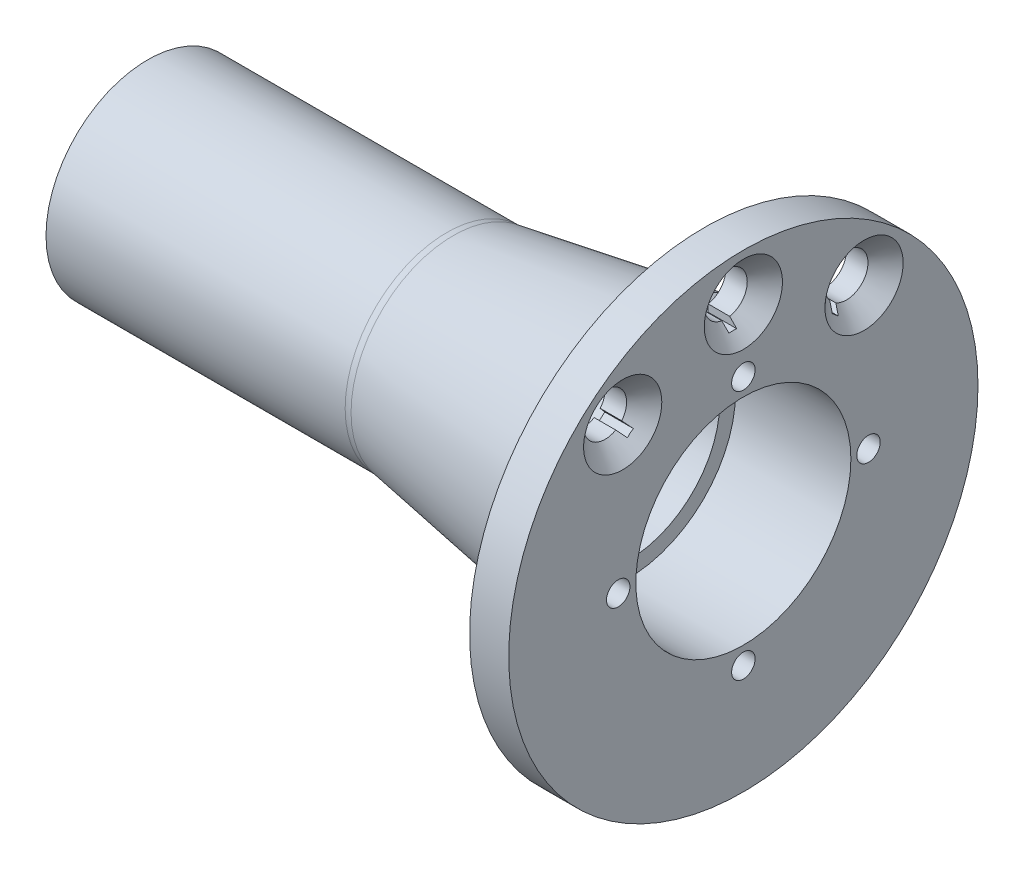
ISO-10303-21;
HEADER;
FILE_DESCRIPTION(('STEP AP214'),'2;1');
FILE_NAME('part.step','',(''),(''),'','','');
FILE_SCHEMA(('AUTOMOTIVE_DESIGN { 1 0 10303 214 1 1 1 1 }'));
ENDSEC;
DATA;
#1=APPLICATION_CONTEXT('core data for automotive mechanical design processes');
#2=APPLICATION_PROTOCOL_DEFINITION('international standard','automotive_design',2000,#1);
#3=PRODUCT_CONTEXT('',#1,'mechanical');
#4=PRODUCT('Part','Part','',(#3));
#5=PRODUCT_RELATED_PRODUCT_CATEGORY('part','',(#4));
#6=PRODUCT_DEFINITION_FORMATION('','',#4);
#7=PRODUCT_DEFINITION_CONTEXT('part definition',#1,'design');
#8=PRODUCT_DEFINITION('design','',#6,#7);
#9=PRODUCT_DEFINITION_SHAPE('','',#8);
#10=(LENGTH_UNIT() NAMED_UNIT(*) SI_UNIT(.MILLI.,.METRE.));
#11=(NAMED_UNIT(*) PLANE_ANGLE_UNIT() SI_UNIT($,.RADIAN.));
#12=(NAMED_UNIT(*) SI_UNIT($,.STERADIAN.) SOLID_ANGLE_UNIT());
#13=UNCERTAINTY_MEASURE_WITH_UNIT(LENGTH_MEASURE(1.E-05),#10,'distance_accuracy_value','');
#14=(GEOMETRIC_REPRESENTATION_CONTEXT(3) GLOBAL_UNCERTAINTY_ASSIGNED_CONTEXT((#13)) GLOBAL_UNIT_ASSIGNED_CONTEXT((#10,
#11,#12)) REPRESENTATION_CONTEXT('',''));
#15=CARTESIAN_POINT('',(0.,0.,0.));
#16=DIRECTION('',(0.,0.,1.));
#17=DIRECTION('',(1.,0.,0.));
#18=AXIS2_PLACEMENT_3D('',#15,#16,#17);
#19=CARTESIAN_POINT('',(0.,0.,0.));
#20=DIRECTION('',(1.,0.,0.));
#21=DIRECTION('',(0.,0.,-1.));
#22=AXIS2_PLACEMENT_3D('',#19,#20,#21);
#23=PLANE('',#22);
#24=CARTESIAN_POINT('',(0.,36.7701332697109,-30.8538052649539));
#25=DIRECTION('',(1.,0.,0.));
#26=DIRECTION('',(0.,0.,-1.));
#27=AXIS2_PLACEMENT_3D('',#24,#25,#26);
#28=CIRCLE('',#27,10.);
#29=CARTESIAN_POINT('',(0.,36.7701332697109,-40.8538052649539));
#30=VERTEX_POINT('',#29);
#31=EDGE_CURVE('E257',#30,#30,#28,.T.);
#32=ORIENTED_EDGE('',*,*,#31,.F.);
#33=EDGE_LOOP('',(#32));
#34=FACE_BOUND('',#33,.T.);
#35=CARTESIAN_POINT('',(0.,48.,0.));
#36=DIRECTION('',(1.,0.,0.));
#37=DIRECTION('',(0.,0.,-1.));
#38=AXIS2_PLACEMENT_3D('',#35,#36,#37);
#39=CIRCLE('',#38,10.);
#40=CARTESIAN_POINT('',(0.,48.,-9.99999999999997));
#41=VERTEX_POINT('',#40);
#42=EDGE_CURVE('E261',#41,#41,#39,.T.);
#43=ORIENTED_EDGE('',*,*,#42,.F.);
#44=EDGE_LOOP('',(#43));
#45=FACE_BOUND('',#44,.T.);
#46=CARTESIAN_POINT('',(0.,3.35182402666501E-13,32.));
#47=DIRECTION('',(1.,0.,0.));
#48=DIRECTION('',(0.,0.,-1.));
#49=AXIS2_PLACEMENT_3D('',#46,#47,#48);
#50=CIRCLE('',#49,3.);
#51=CARTESIAN_POINT('',(0.,3.35182402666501E-13,29.));
#52=VERTEX_POINT('',#51);
#53=EDGE_CURVE('E265',#52,#52,#50,.T.);
#54=ORIENTED_EDGE('',*,*,#53,.F.);
#55=EDGE_LOOP('',(#54));
#56=FACE_BOUND('',#55,.T.);
#57=CARTESIAN_POINT('',(0.,-32.,2.23454935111E-13));
#58=DIRECTION('',(1.,0.,0.));
#59=DIRECTION('',(0.,0.,-1.));
#60=AXIS2_PLACEMENT_3D('',#57,#58,#59);
#61=CIRCLE('',#60,3.);
#62=CARTESIAN_POINT('',(0.,-32.,-2.99999999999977));
#63=VERTEX_POINT('',#62);
#64=EDGE_CURVE('E269',#63,#63,#61,.T.);
#65=ORIENTED_EDGE('',*,*,#64,.F.);
#66=EDGE_LOOP('',(#65));
#67=FACE_BOUND('',#66,.T.);
#68=CARTESIAN_POINT('',(0.,-1.117274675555E-13,-32.));
#69=DIRECTION('',(1.,0.,0.));
#70=DIRECTION('',(0.,0.,-1.));
#71=AXIS2_PLACEMENT_3D('',#68,#69,#70);
#72=CIRCLE('',#71,3.);
#73=CARTESIAN_POINT('',(0.,-1.117274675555E-13,-35.));
#74=VERTEX_POINT('',#73);
#75=EDGE_CURVE('E273',#74,#74,#72,.T.);
#76=ORIENTED_EDGE('',*,*,#75,.F.);
#77=EDGE_LOOP('',(#76));
#78=FACE_BOUND('',#77,.T.);
#79=CARTESIAN_POINT('',(0.,36.7701332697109,30.853805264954));
#80=DIRECTION('',(1.,0.,0.));
#81=DIRECTION('',(0.,0.,-1.));
#82=AXIS2_PLACEMENT_3D('',#79,#80,#81);
#83=CIRCLE('',#82,10.);
#84=CARTESIAN_POINT('',(0.,36.7701332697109,20.853805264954));
#85=VERTEX_POINT('',#84);
#86=EDGE_CURVE('E277',#85,#85,#83,.T.);
#87=ORIENTED_EDGE('',*,*,#86,.F.);
#88=EDGE_LOOP('',(#87));
#89=FACE_BOUND('',#88,.T.);
#90=CARTESIAN_POINT('',(0.,32.,0.));
#91=DIRECTION('',(1.,0.,0.));
#92=DIRECTION('',(0.,0.,-1.));
#93=AXIS2_PLACEMENT_3D('',#90,#91,#92);
#94=CIRCLE('',#93,3.);
#95=CARTESIAN_POINT('',(0.,32.,-3.));
#96=VERTEX_POINT('',#95);
#97=EDGE_CURVE('E281',#96,#96,#94,.T.);
#98=ORIENTED_EDGE('',*,*,#97,.F.);
#99=EDGE_LOOP('',(#98));
#100=FACE_BOUND('',#99,.T.);
#101=CARTESIAN_POINT('',(0.,0.,0.));
#102=DIRECTION('',(1.,0.,0.));
#103=DIRECTION('',(0.,0.,-1.));
#104=AXIS2_PLACEMENT_3D('',#101,#102,#103);
#105=CIRCLE('',#104,27.5);
#106=CARTESIAN_POINT('',(0.,0.,-27.5));
#107=VERTEX_POINT('',#106);
#108=EDGE_CURVE('E285',#107,#107,#105,.T.);
#109=ORIENTED_EDGE('',*,*,#108,.F.);
#110=EDGE_LOOP('',(#109));
#111=FACE_BOUND('',#110,.T.);
#112=CARTESIAN_POINT('',(0.,0.,0.));
#113=DIRECTION('',(1.,0.,0.));
#114=DIRECTION('',(0.,0.,-1.));
#115=AXIS2_PLACEMENT_3D('',#112,#113,#114);
#116=CIRCLE('',#115,60.);
#117=CARTESIAN_POINT('',(0.,0.,-60.));
#118=VERTEX_POINT('',#117);
#119=EDGE_CURVE('E288',#118,#118,#116,.T.);
#120=ORIENTED_EDGE('',*,*,#119,.T.);
#121=EDGE_LOOP('',(#120));
#122=FACE_BOUND('',#121,.T.);
#123=ADVANCED_FACE('F31',(#34,#45,#56,#67,#78,#89,#100,#111,#122),#23,.T.);
#124=CARTESIAN_POINT('',(0.,0.,0.));
#125=DIRECTION('',(1.,0.,0.));
#126=DIRECTION('',(0.,0.,-1.));
#127=AXIS2_PLACEMENT_3D('',#124,#125,#126);
#128=CYLINDRICAL_SURFACE('',#127,60.);
#129=CARTESIAN_POINT('',(-10.,0.,0.));
#130=DIRECTION('',(1.,0.,0.));
#131=DIRECTION('',(0.,0.,-1.));
#132=AXIS2_PLACEMENT_3D('',#129,#130,#131);
#133=CIRCLE('',#132,60.);
#134=CARTESIAN_POINT('',(-10.,0.,-60.));
#135=VERTEX_POINT('',#134);
#136=EDGE_CURVE('E291',#135,#135,#133,.T.);
#137=ORIENTED_EDGE('',*,*,#136,.T.);
#138=EDGE_LOOP('',(#137));
#139=FACE_BOUND('',#138,.T.);
#140=ORIENTED_EDGE('',*,*,#119,.F.);
#141=EDGE_LOOP('',(#140));
#142=FACE_BOUND('',#141,.T.);
#143=ADVANCED_FACE('F246',(#139,#142),#128,.T.);
#144=CARTESIAN_POINT('',(-10.,60.,0.));
#145=DIRECTION('',(-1.,0.,0.));
#146=DIRECTION('',(0.,0.,1.));
#147=AXIS2_PLACEMENT_3D('',#144,#145,#146);
#148=PLANE('',#147);
#149=DIRECTION('',(0.,0.766044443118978,-0.642787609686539));
#150=VECTOR('',#149,1.);
#151=CARTESIAN_POINT('',(-10.,31.8590986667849,-25.4275506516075));
#152=LINE('',#151,#150);
#153=CARTESIAN_POINT('',(-10.,31.8590986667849,-25.4275506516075));
#154=VERTEX_POINT('',#153);
#155=CARTESIAN_POINT('',(-10.,33.2699021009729,-26.6113552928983));
#156=VERTEX_POINT('',#155);
#157=EDGE_CURVE('E142',#154,#156,#152,.T.);
#158=ORIENTED_EDGE('',*,*,#157,.F.);
#159=DIRECTION('',(0.,0.64278760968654,0.766044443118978));
#160=VECTOR('',#159,1.);
#161=CARTESIAN_POINT('',(-10.,30.5735234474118,-26.9596395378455));
#162=LINE('',#161,#160);
#163=CARTESIAN_POINT('',(-10.,30.5735234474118,-26.9596395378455));
#164=VERTEX_POINT('',#163);
#165=EDGE_CURVE('E137',#164,#154,#162,.T.);
#166=ORIENTED_EDGE('',*,*,#165,.F.);
#167=DIRECTION('',(0.,-0.766044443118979,0.642787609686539));
#168=VECTOR('',#167,1.);
#169=CARTESIAN_POINT('',(-10.,36.1273456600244,-31.6198497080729));
#170=LINE('',#169,#168);
#171=CARTESIAN_POINT('',(-10.,31.9843268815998,-28.1434441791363));
#172=VERTEX_POINT('',#171);
#173=EDGE_CURVE('E145',#172,#164,#170,.T.);
#174=ORIENTED_EDGE('',*,*,#173,.F.);
#175=CARTESIAN_POINT('',(-10.,36.7701332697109,-30.8538052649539));
#176=DIRECTION('',(-1.,0.,0.));
#177=DIRECTION('',(0.,0.,1.));
#178=AXIS2_PLACEMENT_3D('',#175,#176,#177);
#179=CIRCLE('',#178,5.49999999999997);
#180=EDGE_CURVE('E509',#156,#172,#179,.T.);
#181=ORIENTED_EDGE('',*,*,#180,.F.);
#182=EDGE_LOOP('',(#158,#166,#174,#181));
#183=FACE_BOUND('',#182,.T.);
#184=DIRECTION('',(0.,1.,0.));
#185=VECTOR('',#184,1.);
#186=CARTESIAN_POINT('',(-10.,40.75,1.00000000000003));
#187=LINE('',#186,#185);
#188=CARTESIAN_POINT('',(-10.,40.75,1.00000000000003));
#189=VERTEX_POINT('',#188);
#190=CARTESIAN_POINT('',(-10.,42.591673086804,1.00000000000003));
#191=VERTEX_POINT('',#190);
#192=EDGE_CURVE('E524',#189,#191,#187,.T.);
#193=ORIENTED_EDGE('',*,*,#192,.F.);
#194=DIRECTION('',(0.,0.,1.));
#195=VECTOR('',#194,1.);
#196=CARTESIAN_POINT('',(-10.,40.75,-0.999999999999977));
#197=LINE('',#196,#195);
#198=CARTESIAN_POINT('',(-10.,40.75,-0.999999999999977));
#199=VERTEX_POINT('',#198);
#200=EDGE_CURVE('E520',#199,#189,#197,.T.);
#201=ORIENTED_EDGE('',*,*,#200,.F.);
#202=DIRECTION('',(0.,-1.,0.));
#203=VECTOR('',#202,1.);
#204=CARTESIAN_POINT('',(-10.,48.,-0.999999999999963));
#205=LINE('',#204,#203);
#206=CARTESIAN_POINT('',(-10.,42.591673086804,-0.999999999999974));
#207=VERTEX_POINT('',#206);
#208=EDGE_CURVE('E518',#207,#199,#205,.T.);
#209=ORIENTED_EDGE('',*,*,#208,.F.);
#210=CARTESIAN_POINT('',(-10.,48.,0.));
#211=DIRECTION('',(-1.,0.,0.));
#212=DIRECTION('',(0.,0.,1.));
#213=AXIS2_PLACEMENT_3D('',#210,#211,#212);
#214=CIRCLE('',#213,5.49999999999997);
#215=EDGE_CURVE('E316',#191,#207,#214,.T.);
#216=ORIENTED_EDGE('',*,*,#215,.F.);
#217=EDGE_LOOP('',(#193,#201,#209,#216));
#218=FACE_BOUND('',#217,.T.);
#219=DIRECTION('',(0.,0.766044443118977,0.642787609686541));
#220=VECTOR('',#219,1.);
#221=CARTESIAN_POINT('',(-10.,30.5735234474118,26.9596395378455));
#222=LINE('',#221,#220);
#223=CARTESIAN_POINT('',(-10.,30.5735234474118,26.9596395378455));
#224=VERTEX_POINT('',#223);
#225=CARTESIAN_POINT('',(-10.,31.9843268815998,28.1434441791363));
#226=VERTEX_POINT('',#225);
#227=EDGE_CURVE('E468',#224,#226,#222,.T.);
#228=ORIENTED_EDGE('',*,*,#227,.F.);
#229=DIRECTION('',(0.,-0.642787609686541,0.766044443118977));
#230=VECTOR('',#229,1.);
#231=CARTESIAN_POINT('',(-10.,31.8590986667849,25.4275506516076));
#232=LINE('',#231,#230);
#233=CARTESIAN_POINT('',(-10.,31.8590986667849,25.4275506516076));
#234=VERTEX_POINT('',#233);
#235=EDGE_CURVE('E469',#234,#224,#232,.T.);
#236=ORIENTED_EDGE('',*,*,#235,.F.);
#237=DIRECTION('',(0.,-0.766044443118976,-0.642787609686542));
#238=VECTOR('',#237,1.);
#239=CARTESIAN_POINT('',(-10.,37.4129208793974,30.087760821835));
#240=LINE('',#239,#238);
#241=CARTESIAN_POINT('',(-10.,33.2699021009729,26.6113552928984));
#242=VERTEX_POINT('',#241);
#243=EDGE_CURVE('E466',#242,#234,#240,.T.);
#244=ORIENTED_EDGE('',*,*,#243,.F.);
#245=CARTESIAN_POINT('',(-10.,36.7701332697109,30.853805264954));
#246=DIRECTION('',(-1.,0.,0.));
#247=DIRECTION('',(0.,0.,1.));
#248=AXIS2_PLACEMENT_3D('',#245,#246,#247);
#249=CIRCLE('',#248,5.49999999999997);
#250=EDGE_CURVE('E301',#226,#242,#249,.T.);
#251=ORIENTED_EDGE('',*,*,#250,.F.);
#252=EDGE_LOOP('',(#228,#236,#244,#251));
#253=FACE_BOUND('',#252,.T.);
#254=CARTESIAN_POINT('',(-10.,0.,0.));
#255=DIRECTION('',(1.,0.,0.));
#256=DIRECTION('',(0.,0.,-1.));
#257=AXIS2_PLACEMENT_3D('',#254,#255,#256);
#258=CIRCLE('',#257,36.);
#259=CARTESIAN_POINT('',(-10.,0.,-36.));
#260=VERTEX_POINT('',#259);
#261=EDGE_CURVE('E297',#260,#260,#258,.T.);
#262=ORIENTED_EDGE('',*,*,#261,.T.);
#263=EDGE_LOOP('',(#262));
#264=FACE_BOUND('',#263,.T.);
#265=ORIENTED_EDGE('',*,*,#136,.F.);
#266=EDGE_LOOP('',(#265));
#267=FACE_BOUND('',#266,.T.);
#268=ADVANCED_FACE('F152',(#183,#218,#253,#264,#267),#148,.T.);
#269=CARTESIAN_POINT('',(0.,0.,0.));
#270=DIRECTION('',(1.,0.,0.));
#271=DIRECTION('',(0.,0.,-1.));
#272=AXIS2_PLACEMENT_3D('',#269,#270,#271);
#273=CYLINDRICAL_SURFACE('',#272,36.);
#274=CARTESIAN_POINT('',(-21.,0.,0.));
#275=DIRECTION('',(1.,0.,0.));
#276=DIRECTION('',(0.,0.,-1.));
#277=AXIS2_PLACEMENT_3D('',#274,#275,#276);
#278=CIRCLE('',#277,36.);
#279=CARTESIAN_POINT('',(-21.,0.,-36.));
#280=VERTEX_POINT('',#279);
#281=EDGE_CURVE('E386',#280,#280,#278,.T.);
#282=ORIENTED_EDGE('',*,*,#281,.T.);
#283=EDGE_LOOP('',(#282));
#284=FACE_BOUND('',#283,.T.);
#285=ORIENTED_EDGE('',*,*,#261,.F.);
#286=EDGE_LOOP('',(#285));
#287=FACE_BOUND('',#286,.T.);
#288=ADVANCED_FACE('F393',(#284,#287),#273,.T.);
#289=CARTESIAN_POINT('',(-21.,36.,0.));
#290=DIRECTION('',(-1.,0.,0.));
#291=DIRECTION('',(0.,0.,1.));
#292=AXIS2_PLACEMENT_3D('',#289,#290,#291);
#293=PLANE('',#292);
#294=CARTESIAN_POINT('',(-21.,0.,0.));
#295=DIRECTION('',(1.,0.,0.));
#296=DIRECTION('',(0.,0.,-1.));
#297=AXIS2_PLACEMENT_3D('',#294,#295,#296);
#298=CIRCLE('',#297,35.);
#299=CARTESIAN_POINT('',(-21.,0.,-35.));
#300=VERTEX_POINT('',#299);
#301=EDGE_CURVE('E383',#300,#300,#298,.T.);
#302=ORIENTED_EDGE('',*,*,#301,.T.);
#303=EDGE_LOOP('',(#302));
#304=FACE_BOUND('',#303,.T.);
#305=ORIENTED_EDGE('',*,*,#281,.F.);
#306=EDGE_LOOP('',(#305));
#307=FACE_BOUND('',#306,.T.);
#308=ADVANCED_FACE('F395',(#304,#307),#293,.T.);
#309=CARTESIAN_POINT('',(-21.,0.,0.));
#310=DIRECTION('',(1.,0.,0.));
#311=DIRECTION('',(0.,0.,-1.));
#312=AXIS2_PLACEMENT_3D('',#309,#310,#311);
#313=CONICAL_SURFACE('',#312,35.,0.165148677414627);
#314=CARTESIAN_POINT('',(-74.1836354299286,0.,0.));
#315=DIRECTION('',(1.,0.,0.));
#316=DIRECTION('',(0.,0.,-1.));
#317=AXIS2_PLACEMENT_3D('',#314,#315,#316);
#318=CIRCLE('',#317,26.1360607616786);
#319=CARTESIAN_POINT('',(-74.1836354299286,0.,-26.1360607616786));
#320=VERTEX_POINT('',#319);
#321=EDGE_CURVE('E38',#320,#320,#318,.T.);
#322=ORIENTED_EDGE('',*,*,#321,.T.);
#323=EDGE_LOOP('',(#322));
#324=FACE_BOUND('',#323,.T.);
#325=ORIENTED_EDGE('',*,*,#301,.F.);
#326=EDGE_LOOP('',(#325));
#327=FACE_BOUND('',#326,.T.);
#328=ADVANCED_FACE('F235',(#324,#327),#313,.T.);
#329=CARTESIAN_POINT('',(0.,0.,0.));
#330=DIRECTION('',(1.,0.,0.));
#331=DIRECTION('',(0.,0.,-1.));
#332=AXIS2_PLACEMENT_3D('',#329,#330,#331);
#333=CYLINDRICAL_SURFACE('',#332,26.);
#334=CARTESIAN_POINT('',(-75.8276253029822,0.,0.));
#335=DIRECTION('',(1.,0.,0.));
#336=DIRECTION('',(0.,0.,-1.));
#337=AXIS2_PLACEMENT_3D('',#334,#335,#336);
#338=CIRCLE('',#337,26.);
#339=CARTESIAN_POINT('',(-75.8276253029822,0.,-26.));
#340=VERTEX_POINT('',#339);
#341=EDGE_CURVE('E11',#340,#340,#338,.F.);
#342=ORIENTED_EDGE('',*,*,#341,.T.);
#343=EDGE_LOOP('',(#342));
#344=FACE_BOUND('',#343,.T.);
#345=CARTESIAN_POINT('',(-152.322861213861,0.,0.));
#346=DIRECTION('',(1.,0.,0.));
#347=DIRECTION('',(0.,0.,-1.));
#348=AXIS2_PLACEMENT_3D('',#345,#346,#347);
#349=CIRCLE('',#348,26.);
#350=CARTESIAN_POINT('',(-152.322861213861,0.,-26.));
#351=VERTEX_POINT('',#350);
#352=EDGE_CURVE('E380',#351,#351,#349,.T.);
#353=ORIENTED_EDGE('',*,*,#352,.T.);
#354=EDGE_LOOP('',(#353));
#355=FACE_BOUND('',#354,.T.);
#356=ADVANCED_FACE('F407',(#344,#355),#333,.T.);
#357=CARTESIAN_POINT('',(-152.322861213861,26.,0.));
#358=DIRECTION('',(-1.,0.,0.));
#359=DIRECTION('',(0.,0.,1.));
#360=AXIS2_PLACEMENT_3D('',#357,#358,#359);
#361=PLANE('',#360);
#362=CARTESIAN_POINT('',(-152.322861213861,0.,0.));
#363=DIRECTION('',(1.,0.,0.));
#364=DIRECTION('',(0.,0.,-1.));
#365=AXIS2_PLACEMENT_3D('',#362,#363,#364);
#366=CIRCLE('',#365,21.);
#367=CARTESIAN_POINT('',(-152.322861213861,0.,-21.));
#368=VERTEX_POINT('',#367);
#369=EDGE_CURVE('E377',#368,#368,#366,.T.);
#370=ORIENTED_EDGE('',*,*,#369,.T.);
#371=EDGE_LOOP('',(#370));
#372=FACE_BOUND('',#371,.T.);
#373=ORIENTED_EDGE('',*,*,#352,.F.);
#374=EDGE_LOOP('',(#373));
#375=FACE_BOUND('',#374,.T.);
#376=ADVANCED_FACE('F409',(#372,#375),#361,.T.);
#377=CARTESIAN_POINT('',(0.,0.,0.));
#378=DIRECTION('',(1.,0.,0.));
#379=DIRECTION('',(0.,0.,-1.));
#380=AXIS2_PLACEMENT_3D('',#377,#378,#379);
#381=CYLINDRICAL_SURFACE('',#380,21.);
#382=ORIENTED_EDGE('',*,*,#369,.F.);
#383=EDGE_LOOP('',(#382));
#384=FACE_BOUND('',#383,.T.);
#385=CARTESIAN_POINT('',(-75.,0.,0.));
#386=DIRECTION('',(1.,0.,0.));
#387=DIRECTION('',(0.,0.,-1.));
#388=AXIS2_PLACEMENT_3D('',#385,#386,#387);
#389=CIRCLE('',#388,21.);
#390=CARTESIAN_POINT('',(-75.,0.,-21.));
#391=VERTEX_POINT('',#390);
#392=EDGE_CURVE('E374',#391,#391,#389,.T.);
#393=ORIENTED_EDGE('',*,*,#392,.T.);
#394=EDGE_LOOP('',(#393));
#395=FACE_BOUND('',#394,.T.);
#396=ADVANCED_FACE('F413',(#384,#395),#381,.F.);
#397=CARTESIAN_POINT('',(-29.5,0.,0.));
#398=DIRECTION('',(1.,0.,0.));
#399=DIRECTION('',(0.,0.,-1.));
#400=AXIS2_PLACEMENT_3D('',#397,#398,#399);
#401=CONICAL_SURFACE('',#400,23.5,0.054889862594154);
#402=ORIENTED_EDGE('',*,*,#392,.F.);
#403=EDGE_LOOP('',(#402));
#404=FACE_BOUND('',#403,.T.);
#405=CARTESIAN_POINT('',(-29.5,0.,0.));
#406=DIRECTION('',(1.,0.,0.));
#407=DIRECTION('',(0.,0.,-1.));
#408=AXIS2_PLACEMENT_3D('',#405,#406,#407);
#409=CIRCLE('',#408,23.5);
#410=CARTESIAN_POINT('',(-29.5,0.,-23.5));
#411=VERTEX_POINT('',#410);
#412=EDGE_CURVE('E371',#411,#411,#409,.T.);
#413=ORIENTED_EDGE('',*,*,#412,.T.);
#414=EDGE_LOOP('',(#413));
#415=FACE_BOUND('',#414,.T.);
#416=ADVANCED_FACE('F417',(#404,#415),#401,.F.);
#417=CARTESIAN_POINT('',(-29.5,27.5,0.));
#418=DIRECTION('',(-1.,0.,0.));
#419=DIRECTION('',(0.,0.,1.));
#420=AXIS2_PLACEMENT_3D('',#417,#418,#419);
#421=PLANE('',#420);
#422=ORIENTED_EDGE('',*,*,#412,.F.);
#423=EDGE_LOOP('',(#422));
#424=FACE_BOUND('',#423,.T.);
#425=CARTESIAN_POINT('',(-29.5,0.,0.));
#426=DIRECTION('',(1.,0.,0.));
#427=DIRECTION('',(0.,0.,-1.));
#428=AXIS2_PLACEMENT_3D('',#425,#426,#427);
#429=CIRCLE('',#428,27.5);
#430=CARTESIAN_POINT('',(-29.5,0.,-27.5));
#431=VERTEX_POINT('',#430);
#432=EDGE_CURVE('E368',#431,#431,#429,.T.);
#433=ORIENTED_EDGE('',*,*,#432,.T.);
#434=EDGE_LOOP('',(#433));
#435=FACE_BOUND('',#434,.T.);
#436=ADVANCED_FACE('F421',(#424,#435),#421,.F.);
#437=CARTESIAN_POINT('',(0.,0.,0.));
#438=DIRECTION('',(1.,0.,0.));
#439=DIRECTION('',(0.,0.,-1.));
#440=AXIS2_PLACEMENT_3D('',#437,#438,#439);
#441=CYLINDRICAL_SURFACE('',#440,27.5);
#442=ORIENTED_EDGE('',*,*,#432,.F.);
#443=EDGE_LOOP('',(#442));
#444=FACE_BOUND('',#443,.T.);
#445=ORIENTED_EDGE('',*,*,#108,.T.);
#446=EDGE_LOOP('',(#445));
#447=FACE_BOUND('',#446,.T.);
#448=ADVANCED_FACE('F425',(#444,#447),#441,.F.);
#449=CARTESIAN_POINT('',(0.,32.,0.));
#450=DIRECTION('',(1.,0.,0.));
#451=DIRECTION('',(0.,0.,-1.));
#452=AXIS2_PLACEMENT_3D('',#449,#450,#451);
#453=CYLINDRICAL_SURFACE('',#452,3.);
#454=CARTESIAN_POINT('',(-12.,32.,0.));
#455=DIRECTION('',(1.,0.,0.));
#456=DIRECTION('',(0.,0.,-1.));
#457=AXIS2_PLACEMENT_3D('',#454,#455,#456);
#458=CIRCLE('',#457,3.);
#459=CARTESIAN_POINT('',(-12.,32.,-3.));
#460=VERTEX_POINT('',#459);
#461=EDGE_CURVE('E363',#460,#460,#458,.T.);
#462=ORIENTED_EDGE('',*,*,#461,.F.);
#463=EDGE_LOOP('',(#462));
#464=FACE_BOUND('',#463,.T.);
#465=ORIENTED_EDGE('',*,*,#97,.T.);
#466=EDGE_LOOP('',(#465));
#467=FACE_BOUND('',#466,.T.);
#468=ADVANCED_FACE('F429',(#464,#467),#453,.F.);
#469=CARTESIAN_POINT('',(-12.,34.5,0.));
#470=DIRECTION('',(-1.,0.,0.));
#471=DIRECTION('',(0.,0.,1.));
#472=AXIS2_PLACEMENT_3D('',#469,#470,#471);
#473=PLANE('',#472);
#474=CARTESIAN_POINT('',(-12.,32.,0.));
#475=DIRECTION('',(1.,0.,0.));
#476=DIRECTION('',(0.,0.,-1.));
#477=AXIS2_PLACEMENT_3D('',#474,#475,#476);
#478=CIRCLE('',#477,2.5);
#479=CARTESIAN_POINT('',(-12.,32.,-2.5));
#480=VERTEX_POINT('',#479);
#481=EDGE_CURVE('E360',#480,#480,#478,.T.);
#482=ORIENTED_EDGE('',*,*,#481,.F.);
#483=EDGE_LOOP('',(#482));
#484=FACE_BOUND('',#483,.T.);
#485=ORIENTED_EDGE('',*,*,#461,.T.);
#486=EDGE_LOOP('',(#485));
#487=FACE_BOUND('',#486,.T.);
#488=ADVANCED_FACE('F433',(#484,#487),#473,.F.);
#489=CARTESIAN_POINT('',(0.,32.,0.));
#490=DIRECTION('',(1.,0.,0.));
#491=DIRECTION('',(0.,0.,-1.));
#492=AXIS2_PLACEMENT_3D('',#489,#490,#491);
#493=CYLINDRICAL_SURFACE('',#492,2.5);
#494=CARTESIAN_POINT('',(-15.,32.,0.));
#495=DIRECTION('',(1.,0.,0.));
#496=DIRECTION('',(0.,0.,-1.));
#497=AXIS2_PLACEMENT_3D('',#494,#495,#496);
#498=CIRCLE('',#497,2.5);
#499=CARTESIAN_POINT('',(-15.,32.,-2.5));
#500=VERTEX_POINT('',#499);
#501=EDGE_CURVE('E303',#500,#500,#498,.T.);
#502=ORIENTED_EDGE('',*,*,#501,.F.);
#503=EDGE_LOOP('',(#502));
#504=FACE_BOUND('',#503,.T.);
#505=ORIENTED_EDGE('',*,*,#481,.T.);
#506=EDGE_LOOP('',(#505));
#507=FACE_BOUND('',#506,.T.);
#508=ADVANCED_FACE('F437',(#504,#507),#493,.F.);
#509=CARTESIAN_POINT('',(-15.,32.,0.));
#510=DIRECTION('',(1.,0.,0.));
#511=DIRECTION('',(0.,0.,-1.));
#512=AXIS2_PLACEMENT_3D('',#509,#510,#511);
#513=CONICAL_SURFACE('',#512,2.5,1.02974425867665);
#514=CARTESIAN_POINT('',(-16.5021515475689,32.,0.));
#515=VERTEX_POINT('',#514);
#516=VERTEX_LOOP('',#515);
#517=FACE_BOUND('',#516,.T.);
#518=ORIENTED_EDGE('',*,*,#501,.T.);
#519=EDGE_LOOP('',(#518));
#520=FACE_BOUND('',#519,.T.);
#521=ADVANCED_FACE('F440',(#517,#520),#513,.F.);
#522=CARTESIAN_POINT('',(0.,36.7701332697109,30.853805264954));
#523=DIRECTION('',(1.,0.,0.));
#524=DIRECTION('',(0.,0.,-1.));
#525=AXIS2_PLACEMENT_3D('',#522,#523,#524);
#526=CONICAL_SURFACE('',#525,10.,0.785398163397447);
#527=CARTESIAN_POINT('',(-2.68132373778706,31.8592664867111,25.4273506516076));
#528=CARTESIAN_POINT('',(-2.70408068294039,31.752525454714,25.5545596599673));
#529=CARTESIAN_POINT('',(-2.7212769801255,31.6452812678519,25.682368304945));
#530=CARTESIAN_POINT('',(-2.74421003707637,31.4307935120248,25.9379848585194));
#531=CARTESIAN_POINT('',(-2.75000000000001,31.3235522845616,26.065789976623));
#532=CARTESIAN_POINT('',(-2.75000000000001,31.109069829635,26.3214002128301));
#533=CARTESIAN_POINT('',(-2.74421003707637,31.0018286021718,26.4492053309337));
#534=CARTESIAN_POINT('',(-2.7212769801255,30.7873408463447,26.7048218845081));
#535=CARTESIAN_POINT('',(-2.70408068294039,30.6800966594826,26.8326305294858));
#536=CARTESIAN_POINT('',(-2.68132373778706,30.5733556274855,26.9598395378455));
#537=B_SPLINE_CURVE_WITH_KNOTS('',3,(#527,#528,#529,#530,#531,#532,#533,#534,#535,#536),
.UNSPECIFIED.,.F.,.F.,(4,2,2,2,4),(0.,0.502773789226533,1.00319685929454,1.50361992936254,
2.00639371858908),.UNSPECIFIED.);
#538=CARTESIAN_POINT('',(-2.68135941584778,31.8590986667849,25.4275506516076));
#539=VERTEX_POINT('',#538);
#540=CARTESIAN_POINT('',(-2.68135941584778,30.5735234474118,26.9596395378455));
#541=VERTEX_POINT('',#540);
#542=EDGE_CURVE('E307',#539,#541,#537,.T.);
#543=ORIENTED_EDGE('',*,*,#542,.T.);
#544=CARTESIAN_POINT('',(3.96954230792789,25.453508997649,22.6634373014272));
#545=CARTESIAN_POINT('',(3.48657376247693,25.8244437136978,22.9746884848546));
#546=CARTESIAN_POINT('',(3.00366030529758,26.1954205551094,23.2859750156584));
#547=CARTESIAN_POINT('',(2.03800177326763,26.9375241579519,23.9086738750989));
#548=CARTESIAN_POINT('',(1.55525670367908,27.3086509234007,24.220086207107));
#549=CARTESIAN_POINT('',(0.589697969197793,28.0513471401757,24.8432823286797));
#550=CARTESIAN_POINT('',(0.106884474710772,28.4229167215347,25.1550662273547));
#551=CARTESIAN_POINT('',(-0.858337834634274,29.166343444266,25.7788753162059));
#552=CARTESIAN_POINT('',(-1.34074666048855,29.5382005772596,26.0909004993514));
#553=CARTESIAN_POINT('',(-2.30180399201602,30.279973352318,26.7133217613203));
#554=CARTESIAN_POINT('',(-2.78045655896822,30.6498859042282,27.023715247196));
#555=CARTESIAN_POINT('',(-3.49761231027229,31.2054101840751,27.4898554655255));
#556=CARTESIAN_POINT('',(-3.73653737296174,31.3907022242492,27.6453339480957));
#557=CARTESIAN_POINT('',(-4.21398227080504,31.7615894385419,27.9565452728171));
#558=CARTESIAN_POINT('',(-4.45250210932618,31.9471846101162,28.1122781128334));
#559=CARTESIAN_POINT('',(-4.92885527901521,32.318740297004,28.4240503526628));
#560=CARTESIAN_POINT('',(-5.16668885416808,32.5047006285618,28.5800895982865));
#561=CARTESIAN_POINT('',(-5.64144622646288,32.8773133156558,28.892748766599));
#562=CARTESIAN_POINT('',(-5.87836999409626,33.0639656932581,29.0493687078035));
#563=CARTESIAN_POINT('',(-6.3506750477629,33.4383622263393,29.363524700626));
#564=CARTESIAN_POINT('',(-6.58605656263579,33.6261062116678,29.5210606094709));
#565=CARTESIAN_POINT('',(-6.9369564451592,33.909294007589,29.7586833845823));
#566=CARTESIAN_POINT('',(-7.05355804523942,34.0039494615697,29.8381087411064));
#567=CARTESIAN_POINT('',(-7.28569233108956,34.1940257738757,29.9976017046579));
#568=CARTESIAN_POINT('',(-7.40122503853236,34.2894466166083,30.0776692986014));
#569=CARTESIAN_POINT('',(-7.5472711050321,34.4116686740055,30.1802257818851));
#570=CARTESIAN_POINT('',(-7.57854584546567,34.437936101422,30.2022667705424));
#571=CARTESIAN_POINT('',(-7.6409529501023,34.4905701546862,30.2464319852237));
#572=CARTESIAN_POINT('',(-7.67208531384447,34.5169367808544,30.2685562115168));
#573=CARTESIAN_POINT('',(-7.76524309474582,34.5962063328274,30.3350712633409));
#574=CARTESIAN_POINT('',(-7.82702646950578,34.6492766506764,30.3796025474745));
#575=CARTESIAN_POINT('',(-7.94986982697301,34.7561201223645,30.4692548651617));
#576=CARTESIAN_POINT('',(-8.01092786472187,34.8098945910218,30.5143770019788));
#577=CARTESIAN_POINT('',(-8.13184609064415,34.9182208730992,30.6052735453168));
#578=CARTESIAN_POINT('',(-8.19170641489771,34.9727725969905,30.651047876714));
#579=CARTESIAN_POINT('',(-8.30282166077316,35.0765146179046,30.7380977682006));
#580=CARTESIAN_POINT('',(-8.35426459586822,35.1255862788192,30.7792737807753));
#581=CARTESIAN_POINT('',(-8.4552429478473,35.224865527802,30.8625789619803));
#582=CARTESIAN_POINT('',(-8.50477863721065,35.2750729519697,30.9047079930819));
#583=CARTESIAN_POINT('',(-8.60096705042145,35.3770087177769,30.9902422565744));
#584=CARTESIAN_POINT('',(-8.64762307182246,35.4287352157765,31.0336459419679));
#585=CARTESIAN_POINT('',(-8.73649883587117,35.5343547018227,31.1222712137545));
#586=CARTESIAN_POINT('',(-8.77872310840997,35.5882453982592,31.1674908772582));
#587=CARTESIAN_POINT('',(-8.85114007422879,35.6921510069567,31.2546780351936));
#588=CARTESIAN_POINT('',(-8.88217633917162,35.7418123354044,31.2963488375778));
#589=CARTESIAN_POINT('',(-8.9354357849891,35.8438203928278,31.3819437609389));
#590=CARTESIAN_POINT('',(-8.95768413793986,35.8961589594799,31.425861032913));
#591=CARTESIAN_POINT('',(-8.98642392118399,35.9936773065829,31.5076886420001));
#592=CARTESIAN_POINT('',(-8.99501232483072,36.0384772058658,31.5452802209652));
#593=CARTESIAN_POINT('',(-9.00171351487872,36.128511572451,31.6208280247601));
#594=CARTESIAN_POINT('',(-8.99983842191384,36.173745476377,31.6587837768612));
#595=CARTESIAN_POINT('',(-8.98608246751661,36.2630559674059,31.7337241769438));
#596=CARTESIAN_POINT('',(-8.97424732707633,36.3071368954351,31.770712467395));
#597=CARTESIAN_POINT('',(-8.95060624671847,36.3719649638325,31.8251096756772));
#598=CARTESIAN_POINT('',(-8.94172894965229,36.3933860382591,31.843084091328));
#599=CARTESIAN_POINT('',(-8.92229807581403,36.4357776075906,31.8786548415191));
#600=CARTESIAN_POINT('',(-8.91174462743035,36.4567481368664,31.8962512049));
#601=CARTESIAN_POINT('',(-8.8832321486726,36.5092939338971,31.9403423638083));
#602=CARTESIAN_POINT('',(-8.86432364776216,36.5405652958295,31.9665821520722));
#603=CARTESIAN_POINT('',(-8.82400336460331,36.6021536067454,32.0182608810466));
#604=CARTESIAN_POINT('',(-8.80259002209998,36.6324699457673,32.0436993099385));
#605=CARTESIAN_POINT('',(-8.73546008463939,36.7223056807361,32.1190804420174));
#606=CARTESIAN_POINT('',(-8.68692926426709,36.780583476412,32.1679813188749));
#607=CARTESIAN_POINT('',(-8.58506729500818,36.8953221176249,32.2642584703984));
#608=CARTESIAN_POINT('',(-8.53169676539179,36.951761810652,32.3116169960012));
#609=CARTESIAN_POINT('',(-8.44957404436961,37.0351579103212,32.3815946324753));
#610=CARTESIAN_POINT('',(-8.42187475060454,37.0627278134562,32.4047285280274));
#611=CARTESIAN_POINT('',(-8.36590234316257,37.1175219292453,32.4507062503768));
#612=CARTESIAN_POINT('',(-8.33762924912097,37.1447461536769,32.4735500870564));
#613=CARTESIAN_POINT('',(-8.24320522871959,37.2344532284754,32.5488232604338));
#614=CARTESIAN_POINT('',(-8.17604644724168,37.2963130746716,32.6007298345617));
#615=CARTESIAN_POINT('',(-8.04010581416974,37.4189797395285,32.7036593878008));
#616=CARTESIAN_POINT('',(-7.97132379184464,37.479786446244,32.754682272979));
#617=CARTESIAN_POINT('',(-7.83261340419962,37.6006582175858,32.8561057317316));
#618=CARTESIAN_POINT('',(-7.76268470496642,37.6607230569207,32.9065061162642));
#619=CARTESIAN_POINT('',(-7.62201284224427,37.780291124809,33.0068356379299));
#620=CARTESIAN_POINT('',(-7.55126966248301,37.8397943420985,33.0567647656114));
#621=CARTESIAN_POINT('',(-7.33796081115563,38.0178274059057,33.2061522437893));
#622=CARTESIAN_POINT('',(-7.19449671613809,38.1357249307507,33.3050800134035));
#623=CARTESIAN_POINT('',(-6.90618332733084,38.3704768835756,33.502060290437));
#624=CARTESIAN_POINT('',(-6.76133428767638,38.4873314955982,33.6001129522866));
#625=CARTESIAN_POINT('',(-6.47154329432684,38.7197021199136,33.7950950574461));
#626=CARTESIAN_POINT('',(-6.3266065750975,38.8352219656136,33.8920277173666));
#627=CARTESIAN_POINT('',(-6.03610230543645,39.0658049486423,34.0855098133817));
#628=CARTESIAN_POINT('',(-5.89053472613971,39.1808680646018,34.1820592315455));
#629=CARTESIAN_POINT('',(-5.453339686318,39.5254372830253,34.4711871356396));
#630=CARTESIAN_POINT('',(-5.16105558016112,39.7544543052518,34.6633552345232));
#631=CARTESIAN_POINT('',(-4.73325998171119,40.0885607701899,34.9437038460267));
#632=CARTESIAN_POINT('',(-4.59813043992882,40.1939379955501,35.0321258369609));
#633=CARTESIAN_POINT('',(-4.32768301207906,40.4045777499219,35.2088735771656));
#634=CARTESIAN_POINT('',(-4.19236510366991,40.5098402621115,35.2971993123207));
#635=CARTESIAN_POINT('',(-3.92124458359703,40.7205344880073,35.4739927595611));
#636=CARTESIAN_POINT('',(-3.78544162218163,40.825965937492,35.5624602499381));
#637=CARTESIAN_POINT('',(-3.5137410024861,41.0367295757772,35.7393119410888));
#638=CARTESIAN_POINT('',(-3.37784335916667,41.1420617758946,35.8276961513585));
#639=CARTESIAN_POINT('',(-3.2419010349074,41.2473601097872,35.9160519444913));
#640=B_SPLINE_CURVE_WITH_KNOTS('',3,(#544,#545,#546,#547,#548,#549,#550,#551,#552,#553,#554,
#555,#556,#557,#558,#559,#560,#561,#562,#563,#564,#565,#566,#567,#568,#569,#570,#571,#572,#573,
#574,#575,#576,#577,#578,#579,#580,#581,#582,#583,#584,#585,#586,#587,#588,#589,#590,#591,#592,
#593,#594,#595,#596,#597,#598,#599,#600,#601,#602,#603,#604,#605,#606,#607,#608,#609,#610,#611,
#612,#613,#614,#615,#616,#617,#618,#619,#620,#621,#622,#623,#624,#625,#626,#627,#628,#629,#630,
#631,#632,#633,#634,#635,#636,#637,#638,#639),.UNSPECIFIED.,.F.,.F.,(4,2,2,2,2,2,2,2,2,2,2,2,2,
2,2,2,2,2,2,2,2,2,2,2,2,2,2,2,2,2,2,2,2,2,2,2,2,2,2,2,2,2,2,2,2,2,2,4),(0.,2.05172037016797,
4.10349995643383,6.15665302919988,8.20974837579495,10.2494993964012,11.2694632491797,
12.2894185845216,13.3089502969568,14.3285148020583,15.3479244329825,15.8576031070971,
16.3672714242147,16.5065012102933,16.645731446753,16.9242040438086,17.2033044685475,
17.482373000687,17.7288220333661,17.9752357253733,18.221361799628,18.4672337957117,
18.6824741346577,18.8970933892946,19.0735881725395,19.2498785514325,19.4253640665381,
19.5133381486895,19.6013054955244,19.7361499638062,19.8710788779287,20.1414854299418,
20.4143331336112,20.5505727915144,20.6868077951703,21.0018586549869,21.3169428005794,
21.6321203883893,21.947304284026,22.5784883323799,23.2095587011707,23.8370324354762,
24.4645351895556,25.7188290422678,26.2973143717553,26.875875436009,27.4559293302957,
28.0359062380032),.UNSPECIFIED.);
#641=CARTESIAN_POINT('',(-4.50000000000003,31.9843268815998,28.1434441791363));
#642=VERTEX_POINT('',#641);
#643=EDGE_CURVE('E345',#541,#642,#640,.T.);
#644=ORIENTED_EDGE('',*,*,#643,.T.);
#645=CARTESIAN_POINT('',(-4.50000000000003,36.7701332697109,30.853805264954));
#646=DIRECTION('',(1.,0.,0.));
#647=DIRECTION('',(0.,0.,-1.));
#648=AXIS2_PLACEMENT_3D('',#645,#646,#647);
#649=CIRCLE('',#648,5.49999999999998);
#650=CARTESIAN_POINT('',(-4.50000000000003,33.2699021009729,26.6113552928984));
#651=VERTEX_POINT('',#650);
#652=EDGE_CURVE('E354',#651,#642,#649,.T.);
#653=ORIENTED_EDGE('',*,*,#652,.F.);
#654=CARTESIAN_POINT('',(-3.24190103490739,42.5329353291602,34.3839630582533));
#655=CARTESIAN_POINT('',(-3.43661354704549,42.3821096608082,34.257405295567));
#656=CARTESIAN_POINT('',(-3.63123966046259,42.2312184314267,34.1307925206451));
#657=CARTESIAN_POINT('',(-4.02034364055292,41.929163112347,33.8773380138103));
#658=CARTESIAN_POINT('',(-4.21482137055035,41.7779989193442,33.7504961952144));
#659=CARTESIAN_POINT('',(-4.60542079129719,41.473878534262,33.4953088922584));
#660=CARTESIAN_POINT('',(-4.80153906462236,41.3209197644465,33.3669612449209));
#661=CARTESIAN_POINT('',(-5.19318458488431,41.0147192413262,33.1100284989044));
#662=CARTESIAN_POINT('',(-5.3887120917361,40.8614776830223,32.9814435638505));
#663=CARTESIAN_POINT('',(-5.85146477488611,40.4975532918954,32.6760747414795));
#664=CARTESIAN_POINT('',(-6.11838760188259,40.286644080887,32.4991009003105));
#665=CARTESIAN_POINT('',(-6.51719106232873,39.9687312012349,32.2323403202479));
#666=CARTESIAN_POINT('',(-6.64998611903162,39.8624014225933,32.1431190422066));
#667=CARTESIAN_POINT('',(-6.91464275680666,39.6491032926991,31.9641406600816));
#668=CARTESIAN_POINT('',(-7.04650452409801,39.542135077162,31.8743836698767));
#669=CARTESIAN_POINT('',(-7.3078276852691,39.3280705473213,31.6947622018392));
#670=CARTESIAN_POINT('',(-7.43729981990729,39.2209819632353,31.6049042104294));
#671=CARTESIAN_POINT('',(-7.62990280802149,39.0591473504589,31.4691088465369));
#672=CARTESIAN_POINT('',(-7.6938616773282,39.004980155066,31.4236571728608));
#673=CARTESIAN_POINT('',(-7.82103857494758,38.8961383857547,31.3323280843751));
#674=CARTESIAN_POINT('',(-7.88425661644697,38.8414638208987,31.2864506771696));
#675=CARTESIAN_POINT('',(-8.00947666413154,38.7316301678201,31.1942892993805));
#676=CARTESIAN_POINT('',(-8.07148208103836,38.6764733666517,31.1480072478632));
#677=CARTESIAN_POINT('',(-8.19409241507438,38.56525613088,31.0546849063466));
#678=CARTESIAN_POINT('',(-8.25469744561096,38.509195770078,31.007644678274));
#679=CARTESIAN_POINT('',(-8.37378483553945,38.3958791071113,30.9125607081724));
#680=CARTESIAN_POINT('',(-8.43226976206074,38.3386243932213,30.8645182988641));
#681=CARTESIAN_POINT('',(-8.54609527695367,38.2223169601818,30.7669247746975));
#682=CARTESIAN_POINT('',(-8.6014374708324,38.163265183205,30.7173744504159));
#683=CARTESIAN_POINT('',(-8.66768167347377,38.0874278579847,30.6537393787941));
#684=CARTESIAN_POINT('',(-8.68101106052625,38.0718861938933,30.6406983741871));
#685=CARTESIAN_POINT('',(-8.70727281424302,38.0406049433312,30.6144502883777));
#686=CARTESIAN_POINT('',(-8.72020513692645,38.0248653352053,30.6012431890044));
#687=CARTESIAN_POINT('',(-8.75832382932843,37.977318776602,30.5613468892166));
#688=CARTESIAN_POINT('',(-8.78282905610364,37.9451873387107,30.5343854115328));
#689=CARTESIAN_POINT('',(-8.8292142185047,37.8801405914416,30.47980470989));
#690=CARTESIAN_POINT('',(-8.85111308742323,37.8472333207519,30.4521922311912));
#691=CARTESIAN_POINT('',(-8.89164364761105,37.7802684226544,30.3960020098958));
#692=CARTESIAN_POINT('',(-8.91027668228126,37.7462112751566,30.3674246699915));
#693=CARTESIAN_POINT('',(-8.94798826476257,37.6666290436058,30.3006472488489));
#694=CARTESIAN_POINT('',(-8.96559740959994,37.620667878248,30.2620812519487));
#695=CARTESIAN_POINT('',(-8.98441257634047,37.5506141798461,30.203299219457));
#696=CARTESIAN_POINT('',(-8.98941619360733,37.52711061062,30.1835773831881));
#697=CARTESIAN_POINT('',(-8.99665566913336,37.4798590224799,30.1439285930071));
#698=CARTESIAN_POINT('',(-8.99889284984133,37.4561111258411,30.1240017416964));
#699=CARTESIAN_POINT('',(-9.00046949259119,37.408422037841,30.0839858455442));
#700=CARTESIAN_POINT('',(-8.99979232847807,37.3844805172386,30.063896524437));
#701=CARTESIAN_POINT('',(-8.99555107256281,37.3367517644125,30.023847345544));
#702=CARTESIAN_POINT('',(-8.99198674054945,37.3129645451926,30.0038874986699));
#703=CARTESIAN_POINT('',(-8.97721805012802,37.2419882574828,29.9443313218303));
#704=CARTESIAN_POINT('',(-8.96193593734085,37.1952852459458,29.9051428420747));
#705=CARTESIAN_POINT('',(-8.92292519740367,37.1032560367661,29.8279211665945));
#706=CARTESIAN_POINT('',(-8.89905809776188,37.0579664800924,29.7899187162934));
#707=CARTESIAN_POINT('',(-8.84560572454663,36.9693713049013,29.7155785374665));
#708=CARTESIAN_POINT('',(-8.81601036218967,36.9260693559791,29.6792438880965));
#709=CARTESIAN_POINT('',(-8.75274274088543,36.8408114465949,29.6077040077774));
#710=CARTESIAN_POINT('',(-8.71903893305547,36.7988694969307,29.5725105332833));
#711=CARTESIAN_POINT('',(-8.64901342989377,36.7163536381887,29.5032715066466));
#712=CARTESIAN_POINT('',(-8.61269392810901,36.6757786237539,29.4692250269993));
#713=CARTESIAN_POINT('',(-8.53508502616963,36.5923019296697,29.3991797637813));
#714=CARTESIAN_POINT('',(-8.49363392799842,36.5494891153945,29.3632555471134));
#715=CARTESIAN_POINT('',(-8.40918189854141,36.4647668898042,29.292165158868));
#716=CARTESIAN_POINT('',(-8.36618075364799,36.4228576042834,29.2569990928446));
#717=CARTESIAN_POINT('',(-8.2354654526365,36.2981173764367,29.1523296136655));
#718=CARTESIAN_POINT('',(-8.14608073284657,36.2163169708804,29.0836909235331));
#719=CARTESIAN_POINT('',(-7.96461082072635,36.0542503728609,28.9477009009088));
#720=CARTESIAN_POINT('',(-7.87252090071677,35.9739873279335,28.880352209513));
#721=CARTESIAN_POINT('',(-7.68674671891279,35.8145964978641,28.7466074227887));
#722=CARTESIAN_POINT('',(-7.59306294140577,35.7354683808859,28.6802110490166));
#723=CARTESIAN_POINT('',(-7.40488058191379,35.5781979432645,28.5482454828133));
#724=CARTESIAN_POINT('',(-7.31038506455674,35.5000534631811,28.4826744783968));
#725=CARTESIAN_POINT('',(-7.12062854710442,35.3443015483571,28.3519831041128));
#726=CARTESIAN_POINT('',(-7.02536749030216,35.2666941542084,28.286862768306));
#727=CARTESIAN_POINT('',(-6.83440174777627,35.1119687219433,28.1570327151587));
#728=CARTESIAN_POINT('',(-6.73869769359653,35.0348502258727,28.0923226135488));
#729=CARTESIAN_POINT('',(-6.54687559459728,34.8809199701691,27.963159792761));
#730=CARTESIAN_POINT('',(-6.45075756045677,34.8041082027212,27.8987070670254));
#731=CARTESIAN_POINT('',(-6.1419299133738,34.5580899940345,27.6922732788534));
#732=CARTESIAN_POINT('',(-5.92860834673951,34.3893345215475,27.5506706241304));
#733=CARTESIAN_POINT('',(-5.50104445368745,34.0525090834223,27.2680405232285));
#734=CARTESIAN_POINT('',(-5.2868021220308,33.8844391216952,27.1270130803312));
#735=CARTESIAN_POINT('',(-4.85770788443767,33.5487489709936,26.8453355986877));
#736=CARTESIAN_POINT('',(-4.6428559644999,33.3811287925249,26.7046855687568));
#737=CARTESIAN_POINT('',(-4.21273580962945,33.046202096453,26.4236487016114));
#738=CARTESIAN_POINT('',(-3.99746757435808,32.8788955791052,26.2832618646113));
#739=CARTESIAN_POINT('',(-3.35097867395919,32.3771189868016,25.8622213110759));
#740=CARTESIAN_POINT('',(-2.91931750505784,32.0429820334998,25.5818471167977));
#741=CARTESIAN_POINT('',(-2.055347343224,31.3752079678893,25.0215181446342));
#742=CARTESIAN_POINT('',(-1.62303835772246,31.0415708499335,24.7415633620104));
#743=CARTESIAN_POINT('',(-0.76090453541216,30.3768414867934,24.1837891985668));
#744=CARTESIAN_POINT('',(-0.331082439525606,30.0457471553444,23.9059680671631));
#745=CARTESIAN_POINT('',(0.528832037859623,29.3837620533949,23.3504966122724));
#746=CARTESIAN_POINT('',(0.958924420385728,29.0528712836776,23.0728462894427));
#747=CARTESIAN_POINT('',(1.81902835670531,28.3914383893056,22.5178381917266));
#748=CARTESIAN_POINT('',(2.24903979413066,28.0608961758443,22.2404803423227));
#749=CARTESIAN_POINT('',(3.10919976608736,27.3999191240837,21.6858547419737));
#750=CARTESIAN_POINT('',(3.53934830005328,27.0694842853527,21.4085869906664));
#751=CARTESIAN_POINT('',(3.9695423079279,26.739084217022,21.1313484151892));
#752=B_SPLINE_CURVE_WITH_KNOTS('',3,(#654,#655,#656,#657,#658,#659,#660,#661,#662,#663,#664,
#665,#666,#667,#668,#669,#670,#671,#672,#673,#674,#675,#676,#677,#678,#679,#680,#681,#682,#683,
#684,#685,#686,#687,#688,#689,#690,#691,#692,#693,#694,#695,#696,#697,#698,#699,#700,#701,#702,
#703,#704,#705,#706,#707,#708,#709,#710,#711,#712,#713,#714,#715,#716,#717,#718,#719,#720,#721,
#722,#723,#724,#725,#726,#727,#728,#729,#730,#731,#732,#733,#734,#735,#736,#737,#738,#739,#740,
#741,#742,#743,#744,#745,#746,#747,#748,#749,#750,#751),.UNSPECIFIED.,.F.,.F.,(4,2,2,2,2,2,2,2,
2,2,2,2,2,2,2,2,2,2,2,2,2,2,2,2,2,2,2,2,2,2,2,2,2,2,2,2,2,2,2,2,2,2,2,2,2,2,2,2,4),(0.,
0.83072503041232,1.66189835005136,2.50153256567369,3.34071790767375,4.49112184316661,
5.06740782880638,5.6435753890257,6.21517782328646,6.50120928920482,6.78723565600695,
7.07228698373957,7.35731514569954,7.641985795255,7.92650968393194,7.9993311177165,
8.07216058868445,8.21783487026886,8.36237633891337,8.50685821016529,8.69367755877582,
8.78683209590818,8.8799420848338,8.97358396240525,9.06723363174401,9.2549214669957,
9.44578338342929,9.63698456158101,9.82975935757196,10.0223743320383,10.2310831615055,
10.4398208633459,10.8575048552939,11.2759682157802,11.6943066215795,12.111458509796,
12.5286415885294,12.9453478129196,13.3620433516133,14.2819956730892,15.2019532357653,
16.1219321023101,17.0419117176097,18.8829145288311,20.7238963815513,22.5525557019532,
24.3812220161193,26.2087499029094,28.0362703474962),.UNSPECIFIED.);
#753=EDGE_CURVE('E338',#651,#539,#752,.T.);
#754=ORIENTED_EDGE('',*,*,#753,.T.);
#755=EDGE_LOOP('',(#543,#644,#653,#754));
#756=FACE_BOUND('',#755,.T.);
#757=ORIENTED_EDGE('',*,*,#86,.T.);
#758=EDGE_LOOP('',(#757));
#759=FACE_BOUND('',#758,.T.);
#760=ADVANCED_FACE('F318',(#756,#759),#526,.F.);
#761=CARTESIAN_POINT('',(0.,36.7701332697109,30.853805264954));
#762=DIRECTION('',(1.,0.,0.));
#763=DIRECTION('',(0.,0.,-1.));
#764=AXIS2_PLACEMENT_3D('',#761,#762,#763);
#765=CYLINDRICAL_SURFACE('',#764,5.49999999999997);
#766=ORIENTED_EDGE('',*,*,#652,.T.);
#767=DIRECTION('',(1.,0.,0.));
#768=VECTOR('',#767,1.);
#769=CARTESIAN_POINT('',(0.,31.9843268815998,28.1434441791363));
#770=LINE('',#769,#768);
#771=EDGE_CURVE('E294',#642,#226,#770,.F.);
#772=ORIENTED_EDGE('',*,*,#771,.T.);
#773=ORIENTED_EDGE('',*,*,#250,.T.);
#774=DIRECTION('',(1.,0.,0.));
#775=VECTOR('',#774,1.);
#776=CARTESIAN_POINT('',(0.,33.2699021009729,26.6113552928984));
#777=LINE('',#776,#775);
#778=EDGE_CURVE('E290',#242,#651,#777,.T.);
#779=ORIENTED_EDGE('',*,*,#778,.T.);
#780=EDGE_LOOP('',(#766,#772,#773,#779));
#781=FACE_BOUND('',#780,.T.);
#782=ADVANCED_FACE('F328',(#781),#765,.F.);
#783=CARTESIAN_POINT('',(0.,31.8590986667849,25.4275506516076));
#784=DIRECTION('',(0.,-0.766044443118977,-0.642787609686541));
#785=DIRECTION('',(0.,0.642787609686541,-0.766044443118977));
#786=AXIS2_PLACEMENT_3D('',#783,#784,#785);
#787=PLANE('',#786);
#788=DIRECTION('',(-1.,0.,0.));
#789=VECTOR('',#788,1.);
#790=CARTESIAN_POINT('',(0.,31.8590986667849,25.4275506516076));
#791=LINE('',#790,#789);
#792=EDGE_CURVE('E347',#539,#234,#791,.T.);
#793=ORIENTED_EDGE('',*,*,#792,.T.);
#794=ORIENTED_EDGE('',*,*,#235,.T.);
#795=DIRECTION('',(-1.,0.,0.));
#796=VECTOR('',#795,1.);
#797=CARTESIAN_POINT('',(0.,30.5735234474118,26.9596395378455));
#798=LINE('',#797,#796);
#799=EDGE_CURVE('E346',#541,#224,#798,.T.);
#800=ORIENTED_EDGE('',*,*,#799,.F.);
#801=ORIENTED_EDGE('',*,*,#542,.F.);
#802=EDGE_LOOP('',(#793,#794,#800,#801));
#803=FACE_BOUND('',#802,.T.);
#804=ADVANCED_FACE('F322',(#803),#787,.F.);
#805=CARTESIAN_POINT('',(0.,30.5735234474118,26.9596395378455));
#806=DIRECTION('',(0.,-0.642787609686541,0.766044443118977));
#807=DIRECTION('',(0.,-0.766044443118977,-0.642787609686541));
#808=AXIS2_PLACEMENT_3D('',#805,#806,#807);
#809=PLANE('',#808);
#810=ORIENTED_EDGE('',*,*,#799,.T.);
#811=ORIENTED_EDGE('',*,*,#227,.T.);
#812=ORIENTED_EDGE('',*,*,#771,.F.);
#813=ORIENTED_EDGE('',*,*,#643,.F.);
#814=EDGE_LOOP('',(#810,#811,#812,#813));
#815=FACE_BOUND('',#814,.T.);
#816=ADVANCED_FACE('F327',(#815),#809,.F.);
#817=CARTESIAN_POINT('',(0.,37.4129208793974,30.087760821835));
#818=DIRECTION('',(0.,0.642787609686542,-0.766044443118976));
#819=DIRECTION('',(0.,0.766044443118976,0.642787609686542));
#820=AXIS2_PLACEMENT_3D('',#817,#818,#819);
#821=PLANE('',#820);
#822=ORIENTED_EDGE('',*,*,#778,.F.);
#823=ORIENTED_EDGE('',*,*,#243,.T.);
#824=ORIENTED_EDGE('',*,*,#792,.F.);
#825=ORIENTED_EDGE('',*,*,#753,.F.);
#826=EDGE_LOOP('',(#822,#823,#824,#825));
#827=FACE_BOUND('',#826,.T.);
#828=ADVANCED_FACE('F332',(#827),#821,.F.);
#829=CARTESIAN_POINT('',(0.,-1.117274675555E-13,-32.));
#830=DIRECTION('',(1.,0.,0.));
#831=DIRECTION('',(0.,0.,-1.));
#832=AXIS2_PLACEMENT_3D('',#829,#830,#831);
#833=CYLINDRICAL_SURFACE('',#832,3.);
#834=CARTESIAN_POINT('',(-12.,-1.117274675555E-13,-32.));
#835=DIRECTION('',(1.,0.,0.));
#836=DIRECTION('',(0.,0.,-1.));
#837=AXIS2_PLACEMENT_3D('',#834,#835,#836);
#838=CIRCLE('',#837,3.);
#839=CARTESIAN_POINT('',(-12.,-1.117274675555E-13,-35.));
#840=VERTEX_POINT('',#839);
#841=EDGE_CURVE('E477',#840,#840,#838,.T.);
#842=ORIENTED_EDGE('',*,*,#841,.F.);
#843=EDGE_LOOP('',(#842));
#844=FACE_BOUND('',#843,.T.);
#845=ORIENTED_EDGE('',*,*,#75,.T.);
#846=EDGE_LOOP('',(#845));
#847=FACE_BOUND('',#846,.T.);
#848=ADVANCED_FACE('F335',(#844,#847),#833,.F.);
#849=CARTESIAN_POINT('',(-12.,2.49999999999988,-32.));
#850=DIRECTION('',(-1.,0.,0.));
#851=DIRECTION('',(0.,0.,1.));
#852=AXIS2_PLACEMENT_3D('',#849,#850,#851);
#853=PLANE('',#852);
#854=CARTESIAN_POINT('',(-12.,-1.117274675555E-13,-32.));
#855=DIRECTION('',(1.,0.,0.));
#856=DIRECTION('',(0.,0.,-1.));
#857=AXIS2_PLACEMENT_3D('',#854,#855,#856);
#858=CIRCLE('',#857,2.5);
#859=CARTESIAN_POINT('',(-12.,-1.117274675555E-13,-34.5));
#860=VERTEX_POINT('',#859);
#861=EDGE_CURVE('E480',#860,#860,#858,.T.);
#862=ORIENTED_EDGE('',*,*,#861,.F.);
#863=EDGE_LOOP('',(#862));
#864=FACE_BOUND('',#863,.T.);
#865=ORIENTED_EDGE('',*,*,#841,.T.);
#866=EDGE_LOOP('',(#865));
#867=FACE_BOUND('',#866,.T.);
#868=ADVANCED_FACE('F556',(#864,#867),#853,.F.);
#869=CARTESIAN_POINT('',(0.,-1.117274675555E-13,-32.));
#870=DIRECTION('',(1.,0.,0.));
#871=DIRECTION('',(0.,0.,-1.));
#872=AXIS2_PLACEMENT_3D('',#869,#870,#871);
#873=CYLINDRICAL_SURFACE('',#872,2.5);
#874=CARTESIAN_POINT('',(-15.,-1.117274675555E-13,-32.));
#875=DIRECTION('',(1.,0.,0.));
#876=DIRECTION('',(0.,0.,-1.));
#877=AXIS2_PLACEMENT_3D('',#874,#875,#876);
#878=CIRCLE('',#877,2.5);
#879=CARTESIAN_POINT('',(-15.,-1.117274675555E-13,-34.5));
#880=VERTEX_POINT('',#879);
#881=EDGE_CURVE('E483',#880,#880,#878,.T.);
#882=ORIENTED_EDGE('',*,*,#881,.F.);
#883=EDGE_LOOP('',(#882));
#884=FACE_BOUND('',#883,.T.);
#885=ORIENTED_EDGE('',*,*,#861,.T.);
#886=EDGE_LOOP('',(#885));
#887=FACE_BOUND('',#886,.T.);
#888=ADVANCED_FACE('F563',(#884,#887),#873,.F.);
#889=CARTESIAN_POINT('',(-15.,-1.117274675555E-13,-32.));
#890=DIRECTION('',(1.,0.,0.));
#891=DIRECTION('',(0.,0.,-1.));
#892=AXIS2_PLACEMENT_3D('',#889,#890,#891);
#893=CONICAL_SURFACE('',#892,2.5,1.02974425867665);
#894=CARTESIAN_POINT('',(-16.5021515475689,-1.1576203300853E-13,-32.));
#895=VERTEX_POINT('',#894);
#896=VERTEX_LOOP('',#895);
#897=FACE_BOUND('',#896,.T.);
#898=ORIENTED_EDGE('',*,*,#881,.T.);
#899=EDGE_LOOP('',(#898));
#900=FACE_BOUND('',#899,.T.);
#901=ADVANCED_FACE('F571',(#897,#900),#893,.F.);
#902=CARTESIAN_POINT('',(0.,-32.,2.23454935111E-13));
#903=DIRECTION('',(1.,0.,0.));
#904=DIRECTION('',(0.,0.,-1.));
#905=AXIS2_PLACEMENT_3D('',#902,#903,#904);
#906=CYLINDRICAL_SURFACE('',#905,3.);
#907=CARTESIAN_POINT('',(-12.,-32.,2.23454935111E-13));
#908=DIRECTION('',(1.,0.,0.));
#909=DIRECTION('',(0.,0.,-1.));
#910=AXIS2_PLACEMENT_3D('',#907,#908,#909);
#911=CIRCLE('',#910,3.);
#912=CARTESIAN_POINT('',(-12.,-32.,-2.99999999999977));
#913=VERTEX_POINT('',#912);
#914=EDGE_CURVE('E487',#913,#913,#911,.T.);
#915=ORIENTED_EDGE('',*,*,#914,.F.);
#916=EDGE_LOOP('',(#915));
#917=FACE_BOUND('',#916,.T.);
#918=ORIENTED_EDGE('',*,*,#64,.T.);
#919=EDGE_LOOP('',(#918));
#920=FACE_BOUND('',#919,.T.);
#921=ADVANCED_FACE('F579',(#917,#920),#906,.F.);
#922=CARTESIAN_POINT('',(-12.,-29.5,2.23454935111E-13));
#923=DIRECTION('',(-1.,0.,0.));
#924=DIRECTION('',(0.,0.,1.));
#925=AXIS2_PLACEMENT_3D('',#922,#923,#924);
#926=PLANE('',#925);
#927=CARTESIAN_POINT('',(-12.,-32.,2.23454935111E-13));
#928=DIRECTION('',(1.,0.,0.));
#929=DIRECTION('',(0.,0.,-1.));
#930=AXIS2_PLACEMENT_3D('',#927,#928,#929);
#931=CIRCLE('',#930,2.5);
#932=CARTESIAN_POINT('',(-12.,-32.,-2.49999999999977));
#933=VERTEX_POINT('',#932);
#934=EDGE_CURVE('E490',#933,#933,#931,.T.);
#935=ORIENTED_EDGE('',*,*,#934,.F.);
#936=EDGE_LOOP('',(#935));
#937=FACE_BOUND('',#936,.T.);
#938=ORIENTED_EDGE('',*,*,#914,.T.);
#939=EDGE_LOOP('',(#938));
#940=FACE_BOUND('',#939,.T.);
#941=ADVANCED_FACE('F587',(#937,#940),#926,.F.);
#942=CARTESIAN_POINT('',(0.,-32.,2.23454935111E-13));
#943=DIRECTION('',(1.,0.,0.));
#944=DIRECTION('',(0.,0.,-1.));
#945=AXIS2_PLACEMENT_3D('',#942,#943,#944);
#946=CYLINDRICAL_SURFACE('',#945,2.5);
#947=CARTESIAN_POINT('',(-15.,-32.,2.23454935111E-13));
#948=DIRECTION('',(1.,0.,0.));
#949=DIRECTION('',(0.,0.,-1.));
#950=AXIS2_PLACEMENT_3D('',#947,#948,#949);
#951=CIRCLE('',#950,2.5);
#952=CARTESIAN_POINT('',(-15.,-32.,-2.49999999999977));
#953=VERTEX_POINT('',#952);
#954=EDGE_CURVE('E493',#953,#953,#951,.T.);
#955=ORIENTED_EDGE('',*,*,#954,.F.);
#956=EDGE_LOOP('',(#955));
#957=FACE_BOUND('',#956,.T.);
#958=ORIENTED_EDGE('',*,*,#934,.T.);
#959=EDGE_LOOP('',(#958));
#960=FACE_BOUND('',#959,.T.);
#961=ADVANCED_FACE('F595',(#957,#960),#946,.F.);
#962=CARTESIAN_POINT('',(-15.,-32.,2.23454935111E-13));
#963=DIRECTION('',(1.,0.,0.));
#964=DIRECTION('',(0.,0.,-1.));
#965=AXIS2_PLACEMENT_3D('',#962,#963,#964);
#966=CONICAL_SURFACE('',#965,2.5,1.02974425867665);
#967=CARTESIAN_POINT('',(-16.5021515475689,-32.,2.23454935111E-13));
#968=VERTEX_POINT('',#967);
#969=VERTEX_LOOP('',#968);
#970=FACE_BOUND('',#969,.T.);
#971=ORIENTED_EDGE('',*,*,#954,.T.);
#972=EDGE_LOOP('',(#971));
#973=FACE_BOUND('',#972,.T.);
#974=ADVANCED_FACE('F603',(#970,#973),#966,.F.);
#975=CARTESIAN_POINT('',(0.,3.35182402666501E-13,32.));
#976=DIRECTION('',(1.,0.,0.));
#977=DIRECTION('',(0.,0.,-1.));
#978=AXIS2_PLACEMENT_3D('',#975,#976,#977);
#979=CYLINDRICAL_SURFACE('',#978,3.);
#980=CARTESIAN_POINT('',(-12.,3.35182402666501E-13,32.));
#981=DIRECTION('',(1.,0.,0.));
#982=DIRECTION('',(0.,0.,-1.));
#983=AXIS2_PLACEMENT_3D('',#980,#981,#982);
#984=CIRCLE('',#983,3.);
#985=CARTESIAN_POINT('',(-12.,3.35182402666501E-13,29.));
#986=VERTEX_POINT('',#985);
#987=EDGE_CURVE('E497',#986,#986,#984,.T.);
#988=ORIENTED_EDGE('',*,*,#987,.F.);
#989=EDGE_LOOP('',(#988));
#990=FACE_BOUND('',#989,.T.);
#991=ORIENTED_EDGE('',*,*,#53,.T.);
#992=EDGE_LOOP('',(#991));
#993=FACE_BOUND('',#992,.T.);
#994=ADVANCED_FACE('F611',(#990,#993),#979,.F.);
#995=CARTESIAN_POINT('',(-12.,2.50000000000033,32.));
#996=DIRECTION('',(-1.,0.,0.));
#997=DIRECTION('',(0.,0.,1.));
#998=AXIS2_PLACEMENT_3D('',#995,#996,#997);
#999=PLANE('',#998);
#1000=CARTESIAN_POINT('',(-12.,3.35182402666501E-13,32.));
#1001=DIRECTION('',(1.,0.,0.));
#1002=DIRECTION('',(0.,0.,-1.));
#1003=AXIS2_PLACEMENT_3D('',#1000,#1001,#1002);
#1004=CIRCLE('',#1003,2.5);
#1005=CARTESIAN_POINT('',(-12.,3.35182402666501E-13,29.5));
#1006=VERTEX_POINT('',#1005);
#1007=EDGE_CURVE('E500',#1006,#1006,#1004,.T.);
#1008=ORIENTED_EDGE('',*,*,#1007,.F.);
#1009=EDGE_LOOP('',(#1008));
#1010=FACE_BOUND('',#1009,.T.);
#1011=ORIENTED_EDGE('',*,*,#987,.T.);
#1012=EDGE_LOOP('',(#1011));
#1013=FACE_BOUND('',#1012,.T.);
#1014=ADVANCED_FACE('F619',(#1010,#1013),#999,.F.);
#1015=CARTESIAN_POINT('',(0.,3.35182402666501E-13,32.));
#1016=DIRECTION('',(1.,0.,0.));
#1017=DIRECTION('',(0.,0.,-1.));
#1018=AXIS2_PLACEMENT_3D('',#1015,#1016,#1017);
#1019=CYLINDRICAL_SURFACE('',#1018,2.5);
#1020=CARTESIAN_POINT('',(-15.,3.35182402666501E-13,32.));
#1021=DIRECTION('',(1.,0.,0.));
#1022=DIRECTION('',(0.,0.,-1.));
#1023=AXIS2_PLACEMENT_3D('',#1020,#1021,#1022);
#1024=CIRCLE('',#1023,2.5);
#1025=CARTESIAN_POINT('',(-15.,3.35182402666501E-13,29.5));
#1026=VERTEX_POINT('',#1025);
#1027=EDGE_CURVE('E503',#1026,#1026,#1024,.T.);
#1028=ORIENTED_EDGE('',*,*,#1027,.F.);
#1029=EDGE_LOOP('',(#1028));
#1030=FACE_BOUND('',#1029,.T.);
#1031=ORIENTED_EDGE('',*,*,#1007,.T.);
#1032=EDGE_LOOP('',(#1031));
#1033=FACE_BOUND('',#1032,.T.);
#1034=ADVANCED_FACE('F627',(#1030,#1033),#1019,.F.);
#1035=CARTESIAN_POINT('',(-15.,3.35182402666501E-13,32.));
#1036=DIRECTION('',(1.,0.,0.));
#1037=DIRECTION('',(0.,0.,-1.));
#1038=AXIS2_PLACEMENT_3D('',#1035,#1036,#1037);
#1039=CONICAL_SURFACE('',#1038,2.5,1.02974425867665);
#1040=CARTESIAN_POINT('',(-16.5021515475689,3.31147837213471E-13,32.));
#1041=VERTEX_POINT('',#1040);
#1042=VERTEX_LOOP('',#1041);
#1043=FACE_BOUND('',#1042,.T.);
#1044=ORIENTED_EDGE('',*,*,#1027,.T.);
#1045=EDGE_LOOP('',(#1044));
#1046=FACE_BOUND('',#1045,.T.);
#1047=ADVANCED_FACE('F210',(#1043,#1046),#1039,.F.);
#1048=CARTESIAN_POINT('',(0.,48.,0.));
#1049=DIRECTION('',(1.,0.,0.));
#1050=DIRECTION('',(0.,0.,-1.));
#1051=AXIS2_PLACEMENT_3D('',#1048,#1049,#1050);
#1052=CONICAL_SURFACE('',#1051,10.,0.785398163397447);
#1053=CARTESIAN_POINT('',(-2.06600286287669,40.75,-3.22270237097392));
#1054=CARTESIAN_POINT('',(-2.15482958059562,40.75,-3.00404752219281));
#1055=CARTESIAN_POINT('',(-2.23723647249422,40.75,-2.78257177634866));
#1056=CARTESIAN_POINT('',(-2.38653684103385,40.75,-2.33390621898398));
#1057=CARTESIAN_POINT('',(-2.45339353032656,40.75,-2.10670423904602));
#1058=CARTESIAN_POINT('',(-2.56777449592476,40.75,-1.65034454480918));
#1059=CARTESIAN_POINT('',(-2.61552477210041,40.75,-1.42124454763));
#1060=CARTESIAN_POINT('',(-2.6902713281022,40.75,-0.959853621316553));
#1061=CARTESIAN_POINT('',(-2.71728874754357,40.75,-0.727566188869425));
#1062=CARTESIAN_POINT('',(-2.74535040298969,40.75,-0.315367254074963));
#1063=CARTESIAN_POINT('',(-2.7509541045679,40.75,-0.135757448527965));
#1064=CARTESIAN_POINT('',(-2.74878116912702,40.75,0.223376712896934));
#1065=CARTESIAN_POINT('',(-2.74100541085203,40.75,0.402901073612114));
#1066=CARTESIAN_POINT('',(-2.71231032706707,40.75,0.761583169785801));
#1067=CARTESIAN_POINT('',(-2.69134038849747,40.75,0.940736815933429));
#1068=CARTESIAN_POINT('',(-2.6369893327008,40.75,1.29709891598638));
#1069=CARTESIAN_POINT('',(-2.60360969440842,40.75,1.47430759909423));
#1070=CARTESIAN_POINT('',(-2.49864192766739,40.75,1.94720416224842));
#1071=CARTESIAN_POINT('',(-2.41656284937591,40.75,2.24058293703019));
#1072=CARTESIAN_POINT('',(-2.22604370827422,40.75,2.81901531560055));
#1073=CARTESIAN_POINT('',(-2.11755601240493,40.75,3.10405282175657));
#1074=CARTESIAN_POINT('',(-1.93969451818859,40.75,3.52449179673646));
#1075=CARTESIAN_POINT('',(-1.87800309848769,40.75,3.66322255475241));
#1076=CARTESIAN_POINT('',(-1.75013123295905,40.75,3.93861837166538));
#1077=CARTESIAN_POINT('',(-1.68395043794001,40.75,4.0752832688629));
#1078=CARTESIAN_POINT('',(-1.54795506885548,40.75,4.3460582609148));
#1079=CARTESIAN_POINT('',(-1.47815706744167,40.75,4.48017672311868));
#1080=CARTESIAN_POINT('',(-1.33515443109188,40.75,4.74653784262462));
#1081=CARTESIAN_POINT('',(-1.26195077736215,40.75,4.87878102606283));
#1082=CARTESIAN_POINT('',(-1.18726537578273,40.75,5.01016881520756));
#1083=B_SPLINE_CURVE_WITH_KNOTS('',3,(#1053,#1054,#1055,#1056,#1057,#1058,#1059,#1060,#1061,
#1062,#1063,#1064,#1065,#1066,#1067,#1068,#1069,#1070,#1071,#1072,#1073,#1074,#1075,#1076,#1077,
#1078,#1079,#1080,#1081,#1082),.UNSPECIFIED.,.F.,.F.,(4,2,2,2,2,2,2,2,2,2,2,2,2,2,4),(0.,
0.708222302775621,1.41810339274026,2.11932010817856,2.81982089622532,3.3584365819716,
3.89701689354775,4.43767590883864,4.97827051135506,5.89054446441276,6.80447623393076,
7.25989951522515,7.71535826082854,8.16888850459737,8.62228888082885),.UNSPECIFIED.);
#1084=CARTESIAN_POINT('',(-2.68135941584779,40.75,-0.999999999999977));
#1085=VERTEX_POINT('',#1084);
#1086=CARTESIAN_POINT('',(-2.68135941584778,40.75,1.00000000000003));
#1087=VERTEX_POINT('',#1086);
#1088=EDGE_CURVE('E216',#1085,#1087,#1083,.T.);
#1089=ORIENTED_EDGE('',*,*,#1088,.T.);
#1090=CARTESIAN_POINT('',(2.4103689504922,35.6299855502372,1.00000000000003));
#1091=CARTESIAN_POINT('',(1.97143924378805,36.0703599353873,1.00000000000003));
#1092=CARTESIAN_POINT('',(1.53257380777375,36.5107984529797,1.00000000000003));
#1093=CARTESIAN_POINT('',(0.655039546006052,37.391912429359,1.00000000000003));
#1094=CARTESIAN_POINT('',(0.216370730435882,37.8325878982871,1.00000000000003));
#1095=CARTESIAN_POINT('',(-0.661157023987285,38.714741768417,1.00000000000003));
#1096=CARTESIAN_POINT('',(-1.10001561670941,39.1562205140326,1.00000000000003));
#1097=CARTESIAN_POINT('',(-1.97723629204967,40.0396311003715,1.00000000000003));
#1098=CARTESIAN_POINT('',(-2.41559839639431,40.4815629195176,1.00000000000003));
#1099=CARTESIAN_POINT('',(-3.26855520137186,41.3429843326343,1.00000000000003));
#1100=CARTESIAN_POINT('',(-3.68318977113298,41.7624344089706,1.00000000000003));
#1101=CARTESIAN_POINT('',(-4.30421699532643,42.3925781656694,1.00000000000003));
#1102=CARTESIAN_POINT('',(-4.51108620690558,42.6028020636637,1.00000000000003));
#1103=CARTESIAN_POINT('',(-4.92436865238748,43.0236925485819,1.00000000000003));
#1104=CARTESIAN_POINT('',(-5.13078189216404,43.2343591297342,1.00000000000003));
#1105=CARTESIAN_POINT('',(-5.54280525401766,43.6561965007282,1.00000000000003));
#1106=CARTESIAN_POINT('',(-5.74841582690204,43.8673668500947,1.00000000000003));
#1107=CARTESIAN_POINT('',(-6.15863291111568,44.2907035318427,1.00000000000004));
#1108=CARTESIAN_POINT('',(-6.36323937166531,44.5028699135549,1.00000000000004));
#1109=CARTESIAN_POINT('',(-6.66883599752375,44.8223284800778,1.00000000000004));
#1110=CARTESIAN_POINT('',(-6.77047087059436,44.9290036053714,1.00000000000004));
#1111=CARTESIAN_POINT('',(-6.97315457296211,45.1429087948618,1.00000000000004));
#1112=CARTESIAN_POINT('',(-7.07420340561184,45.2501388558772,1.00000000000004));
#1113=CARTESIAN_POINT('',(-7.27548153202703,45.4653497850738,1.00000000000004));
#1114=CARTESIAN_POINT('',(-7.3757108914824,45.5733305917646,1.00000000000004));
#1115=CARTESIAN_POINT('',(-7.57500011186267,45.7903649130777,1.00000000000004));
#1116=CARTESIAN_POINT('',(-7.67406000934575,45.8994183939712,1.00000000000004));
#1117=CARTESIAN_POINT('',(-7.79957243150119,46.0398810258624,1.00000000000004));
#1118=CARTESIAN_POINT('',(-7.8268525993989,46.0705508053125,1.00000000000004));
#1119=CARTESIAN_POINT('',(-7.88125185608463,46.1320333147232,1.00000000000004));
#1120=CARTESIAN_POINT('',(-7.90837094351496,46.1628460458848,1.00000000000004));
#1121=CARTESIAN_POINT('',(-7.98945918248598,46.2555308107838,1.00000000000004));
#1122=CARTESIAN_POINT('',(-8.04315409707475,46.3176435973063,1.00000000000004));
#1123=CARTESIAN_POINT('',(-8.1500376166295,46.4432532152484,1.00000000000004));
#1124=CARTESIAN_POINT('',(-8.20321757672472,46.5067574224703,1.00000000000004));
#1125=CARTESIAN_POINT('',(-8.30819318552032,46.634876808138,1.00000000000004));
#1126=CARTESIAN_POINT('',(-8.3599892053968,46.6994916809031,1.00000000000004));
#1127=CARTESIAN_POINT('',(-8.46210286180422,46.8308729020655,1.00000000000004));
#1128=CARTESIAN_POINT('',(-8.51240185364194,46.897653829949,1.00000000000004));
#1129=CARTESIAN_POINT('',(-8.61007057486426,47.0334902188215,1.00000000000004));
#1130=CARTESIAN_POINT('',(-8.65743639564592,47.1025485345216,1.00000000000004));
#1131=CARTESIAN_POINT('',(-8.7470288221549,47.2431235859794,1.00000000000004));
#1132=CARTESIAN_POINT('',(-8.78929617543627,47.3146140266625,1.00000000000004));
#1133=CARTESIAN_POINT('',(-8.86601678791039,47.4616387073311,1.00000000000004));
#1134=CARTESIAN_POINT('',(-8.900493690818,47.5371598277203,1.00000000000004));
#1135=CARTESIAN_POINT('',(-8.93912420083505,47.6447307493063,1.00000000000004));
#1136=CARTESIAN_POINT('',(-8.94884218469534,47.6747706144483,1.00000000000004));
#1137=CARTESIAN_POINT('',(-8.96602106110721,47.7354876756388,1.00000000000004));
#1138=CARTESIAN_POINT('',(-8.97348188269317,47.7661648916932,1.00000000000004));
#1139=CARTESIAN_POINT('',(-8.99186792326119,47.8587761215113,1.00000000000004));
#1140=CARTESIAN_POINT('',(-8.99890235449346,47.9215662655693,1.00000000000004));
#1141=CARTESIAN_POINT('',(-9.00086047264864,48.0476308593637,1.00000000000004));
#1142=CARTESIAN_POINT('',(-8.99572549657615,48.1109061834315,1.00000000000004));
#1143=CARTESIAN_POINT('',(-8.97446515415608,48.2356861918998,1.00000000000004));
#1144=CARTESIAN_POINT('',(-8.95830134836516,48.2971838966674,1.00000000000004));
#1145=CARTESIAN_POINT('',(-8.9169994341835,48.4200013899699,1.00000000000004));
#1146=CARTESIAN_POINT('',(-8.89149449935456,48.4811918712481,1.00000000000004));
#1147=CARTESIAN_POINT('',(-8.83458193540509,48.6008101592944,1.00000000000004));
#1148=CARTESIAN_POINT('',(-8.80316331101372,48.6592325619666,1.00000000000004));
#1149=CARTESIAN_POINT('',(-8.73618550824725,48.774226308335,1.00000000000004));
#1150=CARTESIAN_POINT('',(-8.70059588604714,48.8307796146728,1.00000000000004));
#1151=CARTESIAN_POINT('',(-8.64522937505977,48.9142382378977,1.00000000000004));
#1152=CARTESIAN_POINT('',(-8.62645163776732,48.9418181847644,1.00000000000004));
#1153=CARTESIAN_POINT('',(-8.58833485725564,48.9965868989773,1.00000000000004));
#1154=CARTESIAN_POINT('',(-8.56899582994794,49.0237756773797,1.00000000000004));
#1155=CARTESIAN_POINT('',(-8.50670571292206,49.1097694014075,1.00000000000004));
#1156=CARTESIAN_POINT('',(-8.46287761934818,49.1679387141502,1.00000000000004));
#1157=CARTESIAN_POINT('',(-8.3736645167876,49.283074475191,1.00000000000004));
#1158=CARTESIAN_POINT('',(-8.3282792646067,49.340040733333,1.00000000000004));
#1159=CARTESIAN_POINT('',(-8.19041324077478,49.5096321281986,1.00000000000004));
#1160=CARTESIAN_POINT('',(-8.09626243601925,49.6208962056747,1.00000000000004));
#1161=CARTESIAN_POINT('',(-7.90528618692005,49.8414170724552,1.00000000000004));
#1162=CARTESIAN_POINT('',(-7.80845634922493,49.9506700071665,1.00000000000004));
#1163=CARTESIAN_POINT('',(-7.61322468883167,50.1677040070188,1.00000000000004));
#1164=CARTESIAN_POINT('',(-7.51482331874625,50.2754854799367,1.00000000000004));
#1165=CARTESIAN_POINT('',(-7.31727135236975,50.4897265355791,1.00000000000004));
#1166=CARTESIAN_POINT('',(-7.21812410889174,50.5961892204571,1.00000000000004));
#1167=CARTESIAN_POINT('',(-7.01907835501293,50.8084232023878,1.00000000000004));
#1168=CARTESIAN_POINT('',(-6.91917979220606,50.9141944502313,1.00000000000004));
#1169=CARTESIAN_POINT('',(-6.61886498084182,51.230560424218,1.00000000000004));
#1170=CARTESIAN_POINT('',(-6.41765203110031,51.4403982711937,1.00000000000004));
#1171=CARTESIAN_POINT('',(-6.09709561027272,51.7727548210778,1.00000000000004));
#1172=CARTESIAN_POINT('',(-5.97814930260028,51.8956581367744,1.00000000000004));
#1173=CARTESIAN_POINT('',(-5.73990116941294,52.1411750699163,1.00000000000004));
#1174=CARTESIAN_POINT('',(-5.62059926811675,52.2637886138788,1.00000000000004));
#1175=CARTESIAN_POINT('',(-5.38172082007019,52.5087961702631,1.00000000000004));
#1176=CARTESIAN_POINT('',(-5.26214422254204,52.6311901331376,1.00000000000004));
#1177=CARTESIAN_POINT('',(-5.02281817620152,52.8757523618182,1.00000000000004));
#1178=CARTESIAN_POINT('',(-4.903068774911,52.9979206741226,1.00000000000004));
#1179=CARTESIAN_POINT('',(-4.78324353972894,53.1200144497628,1.00000000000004));
#1180=B_SPLINE_CURVE_WITH_KNOTS('',3,(#1090,#1091,#1092,#1093,#1094,#1095,#1096,#1097,#1098,
#1099,#1100,#1101,#1102,#1103,#1104,#1105,#1106,#1107,#1108,#1109,#1110,#1111,#1112,#1113,#1114,
#1115,#1116,#1117,#1118,#1119,#1120,#1121,#1122,#1123,#1124,#1125,#1126,#1127,#1128,#1129,#1130,
#1131,#1132,#1133,#1134,#1135,#1136,#1137,#1138,#1139,#1140,#1141,#1142,#1143,#1144,#1145,#1146,
#1147,#1148,#1149,#1150,#1151,#1152,#1153,#1154,#1155,#1156,#1157,#1158,#1159,#1160,#1161,#1162,
#1163,#1164,#1165,#1166,#1167,#1168,#1169,#1170,#1171,#1172,#1173,#1174,#1175,#1176,#1177,#1178,
#1179),.UNSPECIFIED.,.F.,.F.,(4,2,2,2,2,2,2,2,2,2,2,2,2,2,2,2,2,2,2,2,2,2,2,2,2,2,2,2,2,2,2,2,2,
2,2,2,2,2,2,2,2,2,2,2,4),(0.,1.86528824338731,3.73066394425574,5.59814946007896,
7.46554982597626,9.23493818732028,10.1197544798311,11.0045593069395,11.8887622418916,
12.7730094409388,13.2150295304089,13.6570470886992,14.0990288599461,14.5409967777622,
14.6641367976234,14.7872778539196,15.0335834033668,15.2820617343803,15.5304727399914,
15.7812361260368,16.0323267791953,16.2812549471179,16.5294171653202,16.6240566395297,
16.7186990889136,16.9071060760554,17.0964231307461,17.2864034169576,17.4848246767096,
17.6836185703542,17.8839662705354,17.9840579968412,18.0841468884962,18.30260164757,
18.5210906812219,18.9582698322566,19.3962142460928,19.8340347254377,20.2704708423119,
20.7069376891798,21.5790892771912,22.092198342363,22.6054259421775,23.1187575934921,
23.6319679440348),.UNSPECIFIED.);
#1181=CARTESIAN_POINT('',(-4.50000000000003,42.591673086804,1.00000000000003));
#1182=VERTEX_POINT('',#1181);
#1183=EDGE_CURVE('E191',#1087,#1182,#1180,.T.);
#1184=ORIENTED_EDGE('',*,*,#1183,.T.);
#1185=CARTESIAN_POINT('',(-4.50000000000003,48.,0.));
#1186=DIRECTION('',(1.,0.,0.));
#1187=DIRECTION('',(0.,0.,-1.));
#1188=AXIS2_PLACEMENT_3D('',#1185,#1186,#1187);
#1189=CIRCLE('',#1188,5.49999999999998);
#1190=CARTESIAN_POINT('',(-4.50000000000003,42.591673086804,-0.999999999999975));
#1191=VERTEX_POINT('',#1190);
#1192=EDGE_CURVE('E507',#1191,#1182,#1189,.T.);
#1193=ORIENTED_EDGE('',*,*,#1192,.F.);
#1194=CARTESIAN_POINT('',(-4.78324353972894,53.1200144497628,-0.999999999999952));
#1195=CARTESIAN_POINT('',(-4.90974315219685,52.991118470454,-0.999999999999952));
#1196=CARTESIAN_POINT('',(-5.0361593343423,52.862140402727,-0.999999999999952));
#1197=CARTESIAN_POINT('',(-5.28894001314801,52.6037828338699,-0.999999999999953));
#1198=CARTESIAN_POINT('',(-5.41530419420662,52.4744030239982,-0.999999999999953));
#1199=CARTESIAN_POINT('',(-5.67073041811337,52.2122982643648,-0.999999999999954));
#1200=CARTESIAN_POINT('',(-5.79978556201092,52.0795665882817,-0.999999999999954));
#1201=CARTESIAN_POINT('',(-6.0573151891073,51.8138995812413,-0.999999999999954));
#1202=CARTESIAN_POINT('',(-6.18579023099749,51.6809647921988,-0.999999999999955));
#1203=CARTESIAN_POINT('',(-6.42885772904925,51.4284260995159,-0.999999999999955));
#1204=CARTESIAN_POINT('',(-6.54350400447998,51.3088740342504,-0.999999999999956));
#1205=CARTESIAN_POINT('',(-6.77221821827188,51.0691796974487,-0.999999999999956));
#1206=CARTESIAN_POINT('',(-6.88628605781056,50.949037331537,-0.999999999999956));
#1207=CARTESIAN_POINT('',(-7.11420830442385,50.7072925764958,-0.999999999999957));
#1208=CARTESIAN_POINT('',(-7.22805805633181,50.5856857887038,-0.999999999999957));
#1209=CARTESIAN_POINT('',(-7.45442466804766,50.3413812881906,-0.999999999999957));
#1210=CARTESIAN_POINT('',(-7.56694233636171,50.2186843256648,-0.999999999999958));
#1211=CARTESIAN_POINT('',(-7.78758240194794,49.9742191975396,-0.999999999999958));
#1212=CARTESIAN_POINT('',(-7.89574709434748,49.8524895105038,-0.999999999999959));
#1213=CARTESIAN_POINT('',(-8.0557347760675,49.6676640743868,-0.999999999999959));
#1214=CARTESIAN_POINT('',(-8.10875257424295,49.605604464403,-0.999999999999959));
#1215=CARTESIAN_POINT('',(-8.21368864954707,49.4805644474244,-0.999999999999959));
#1216=CARTESIAN_POINT('',(-8.26560698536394,49.417584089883,-0.99999999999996));
#1217=CARTESIAN_POINT('',(-8.36736355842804,49.2910848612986,-0.99999999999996));
#1218=CARTESIAN_POINT('',(-8.41721828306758,49.2275793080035,-0.99999999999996));
#1219=CARTESIAN_POINT('',(-8.51481499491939,49.0988814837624,-0.99999999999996));
#1220=CARTESIAN_POINT('',(-8.56255556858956,49.0336881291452,-0.99999999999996));
#1221=CARTESIAN_POINT('',(-8.65459261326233,48.901322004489,-0.999999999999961));
#1222=CARTESIAN_POINT('',(-8.69890324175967,48.83415914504,-0.999999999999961));
#1223=CARTESIAN_POINT('',(-8.7824252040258,48.6967576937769,-0.999999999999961));
#1224=CARTESIAN_POINT('',(-8.82164464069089,48.626524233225,-0.999999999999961));
#1225=CARTESIAN_POINT('',(-8.86411810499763,48.5388923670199,-0.999999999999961));
#1226=CARTESIAN_POINT('',(-8.87137817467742,48.5234298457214,-0.999999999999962));
#1227=CARTESIAN_POINT('',(-8.88547247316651,48.4923058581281,-0.999999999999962));
#1228=CARTESIAN_POINT('',(-8.89230655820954,48.4766443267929,-0.999999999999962));
#1229=CARTESIAN_POINT('',(-8.91209623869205,48.4293642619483,-0.999999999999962));
#1230=CARTESIAN_POINT('',(-8.92434285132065,48.3974429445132,-0.999999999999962));
#1231=CARTESIAN_POINT('',(-8.94635203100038,48.3332693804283,-0.999999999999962));
#1232=CARTESIAN_POINT('',(-8.95614834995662,48.3010288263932,-0.999999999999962));
#1233=CARTESIAN_POINT('',(-8.97305078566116,48.2358289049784,-0.999999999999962));
#1234=CARTESIAN_POINT('',(-8.98015612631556,48.202869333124,-0.999999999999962));
#1235=CARTESIAN_POINT('',(-8.99139315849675,48.1356757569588,-0.999999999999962));
#1236=CARTESIAN_POINT('',(-8.99545454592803,48.1014297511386,-0.999999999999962));
#1237=CARTESIAN_POINT('',(-9.00005211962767,48.0327102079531,-0.999999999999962));
#1238=CARTESIAN_POINT('',(-9.00058964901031,47.9982367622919,-0.999999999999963));
#1239=CARTESIAN_POINT('',(-8.9981015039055,47.9293954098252,-0.999999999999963));
#1240=CARTESIAN_POINT('',(-8.99507317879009,47.8950276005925,-0.999999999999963));
#1241=CARTESIAN_POINT('',(-8.9856677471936,47.8267508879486,-0.999999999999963));
#1242=CARTESIAN_POINT('',(-8.97928936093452,47.7928421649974,-0.999999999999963));
#1243=CARTESIAN_POINT('',(-8.96170183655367,47.7176903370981,-0.999999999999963));
#1244=CARTESIAN_POINT('',(-8.9497019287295,47.6766340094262,-0.999999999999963));
#1245=CARTESIAN_POINT('',(-8.9220627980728,47.5957772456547,-0.999999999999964));
#1246=CARTESIAN_POINT('',(-8.90642201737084,47.555977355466,-0.999999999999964));
#1247=CARTESIAN_POINT('',(-8.87222078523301,47.4773645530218,-0.999999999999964));
#1248=CARTESIAN_POINT('',(-8.85364216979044,47.4385596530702,-0.999999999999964));
#1249=CARTESIAN_POINT('',(-8.81431316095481,47.3620937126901,-0.999999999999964));
#1250=CARTESIAN_POINT('',(-8.79356334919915,47.3244323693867,-0.999999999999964));
#1251=CARTESIAN_POINT('',(-8.72737398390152,47.2103614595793,-0.999999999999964));
#1252=CARTESIAN_POINT('',(-8.6792340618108,47.1355273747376,-0.999999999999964));
#1253=CARTESIAN_POINT('',(-8.57877213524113,46.9886981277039,-0.999999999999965));
#1254=CARTESIAN_POINT('',(-8.5264460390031,46.916705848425,-0.999999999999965));
#1255=CARTESIAN_POINT('',(-8.41900535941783,46.7745570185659,-0.999999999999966));
#1256=CARTESIAN_POINT('',(-8.36388404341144,46.704405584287,-0.999999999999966));
#1257=CARTESIAN_POINT('',(-8.25185806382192,46.5655391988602,-0.999999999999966));
#1258=CARTESIAN_POINT('',(-8.19495318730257,46.4968244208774,-0.999999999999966));
#1259=CARTESIAN_POINT('',(-8.07971661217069,46.3602334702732,-0.999999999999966));
#1260=CARTESIAN_POINT('',(-8.02138097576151,46.2923606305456,-0.999999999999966));
#1261=CARTESIAN_POINT('',(-7.90379574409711,46.1574020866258,-0.999999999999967));
#1262=CARTESIAN_POINT('',(-7.8445460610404,46.0903164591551,-0.999999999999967));
#1263=CARTESIAN_POINT('',(-7.72547561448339,45.9568734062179,-0.999999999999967));
#1264=CARTESIAN_POINT('',(-7.66565608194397,45.8905148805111,-0.999999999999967));
#1265=CARTESIAN_POINT('',(-7.54549862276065,45.7582738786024,-0.999999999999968));
#1266=CARTESIAN_POINT('',(-7.48516071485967,45.6923913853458,-0.999999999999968));
#1267=CARTESIAN_POINT('',(-7.30508987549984,45.4969821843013,-0.999999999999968));
#1268=CARTESIAN_POINT('',(-7.1847720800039,45.3679947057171,-0.999999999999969));
#1269=CARTESIAN_POINT('',(-6.943114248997,45.1109801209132,-0.999999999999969));
#1270=CARTESIAN_POINT('',(-6.82177419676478,44.9829530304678,-0.999999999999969));
#1271=CARTESIAN_POINT('',(-6.45670305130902,44.5998466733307,-0.99999999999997));
#1272=CARTESIAN_POINT('',(-6.21193453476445,44.3457568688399,-0.999999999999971));
#1273=CARTESIAN_POINT('',(-5.72075967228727,43.8387826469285,-0.999999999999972));
#1274=CARTESIAN_POINT('',(-5.47435218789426,43.5858993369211,-0.999999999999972));
#1275=CARTESIAN_POINT('',(-4.98066365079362,43.0810024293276,-0.999999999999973));
#1276=CARTESIAN_POINT('',(-4.73338262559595,42.8289888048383,-0.999999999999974));
#1277=CARTESIAN_POINT('',(-4.23928226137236,42.3265600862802,-0.999999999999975));
#1278=CARTESIAN_POINT('',(-3.99246525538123,42.0761426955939,-0.999999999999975));
#1279=CARTESIAN_POINT('',(-3.4984444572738,41.5756857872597,-0.999999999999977));
#1280=CARTESIAN_POINT('',(-3.25124066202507,41.3256462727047,-0.999999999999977));
#1281=CARTESIAN_POINT('',(-2.50934780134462,40.5760495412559,-0.999999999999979));
#1282=CARTESIAN_POINT('',(-2.01425596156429,40.0768910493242,-0.99999999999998));
#1283=CARTESIAN_POINT('',(-1.19227687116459,39.2491470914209,-0.999999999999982));
#1284=CARTESIAN_POINT('',(-0.865557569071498,38.9203947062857,-0.999999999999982));
#1285=CARTESIAN_POINT('',(-0.211904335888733,38.2630581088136,-0.999999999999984));
#1286=CARTESIAN_POINT('',(0.115029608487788,37.9344739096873,-0.999999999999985));
#1287=CARTESIAN_POINT('',(0.769980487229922,37.2764990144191,-0.999999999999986));
#1288=CARTESIAN_POINT('',(1.09799782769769,36.9471087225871,-0.999999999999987));
#1289=CARTESIAN_POINT('',(1.7541199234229,36.2884610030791,-0.999999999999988));
#1290=CARTESIAN_POINT('',(2.08222467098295,35.9592035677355,-0.999999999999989));
#1291=CARTESIAN_POINT('',(2.41036895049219,35.6299855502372,-0.99999999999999));
#1292=B_SPLINE_CURVE_WITH_KNOTS('',3,(#1194,#1195,#1196,#1197,#1198,#1199,#1200,#1201,#1202,
#1203,#1204,#1205,#1206,#1207,#1208,#1209,#1210,#1211,#1212,#1213,#1214,#1215,#1216,#1217,#1218,
#1219,#1220,#1221,#1222,#1223,#1224,#1225,#1226,#1227,#1228,#1229,#1230,#1231,#1232,#1233,#1234,
#1235,#1236,#1237,#1238,#1239,#1240,#1241,#1242,#1243,#1244,#1245,#1246,#1247,#1248,#1249,#1250,
#1251,#1252,#1253,#1254,#1255,#1256,#1257,#1258,#1259,#1260,#1261,#1262,#1263,#1264,#1265,#1266,
#1267,#1268,#1269,#1270,#1271,#1272,#1273,#1274,#1275,#1276,#1277,#1278,#1279,#1280,#1281,#1282,
#1283,#1284,#1285,#1286,#1287,#1288,#1289,#1290,#1291),.UNSPECIFIED.,.F.,.F.,(4,2,2,2,2,2,2,2,2,
2,2,2,2,2,2,2,2,2,2,2,2,2,2,2,2,2,2,2,2,2,2,2,2,2,2,2,2,2,2,2,2,2,2,2,2,2,2,2,4),(0.,
0.541799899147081,1.08435224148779,1.63974009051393,2.19435364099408,2.69127081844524,
3.18827020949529,3.68801348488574,4.18743604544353,4.67592433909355,4.92078403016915,
5.16563061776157,5.40781283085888,5.65015459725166,5.89143585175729,6.13232825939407,
6.18356889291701,6.23482672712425,6.33731798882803,6.43830828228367,6.53932767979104,
6.64261387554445,6.74586070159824,6.84918432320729,6.95254744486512,7.0806468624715,
7.20880119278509,7.33778130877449,7.46672696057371,7.73339013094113,8.00031721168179,
8.26792096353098,8.53555678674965,8.80403765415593,9.07254447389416,9.3405642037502,
9.60857428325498,10.1377402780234,10.6669149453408,11.725323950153,12.7845668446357,
13.843776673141,14.8985972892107,15.9534264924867,18.0625664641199,19.4530385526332,
20.8436068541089,22.2381820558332,23.6326599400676),.UNSPECIFIED.);
#1293=EDGE_CURVE('E53',#1191,#1085,#1292,.T.);
#1294=ORIENTED_EDGE('',*,*,#1293,.T.);
#1295=EDGE_LOOP('',(#1089,#1184,#1193,#1294));
#1296=FACE_BOUND('',#1295,.T.);
#1297=ORIENTED_EDGE('',*,*,#42,.T.);
#1298=EDGE_LOOP('',(#1297));
#1299=FACE_BOUND('',#1298,.T.);
#1300=ADVANCED_FACE('F205',(#1296,#1299),#1052,.F.);
#1301=CARTESIAN_POINT('',(0.,48.,0.));
#1302=DIRECTION('',(1.,0.,0.));
#1303=DIRECTION('',(0.,0.,-1.));
#1304=AXIS2_PLACEMENT_3D('',#1301,#1302,#1303);
#1305=CYLINDRICAL_SURFACE('',#1304,5.49999999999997);
#1306=ORIENTED_EDGE('',*,*,#1192,.T.);
#1307=DIRECTION('',(1.,0.,0.));
#1308=VECTOR('',#1307,1.);
#1309=CARTESIAN_POINT('',(0.,42.591673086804,1.00000000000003));
#1310=LINE('',#1309,#1308);
#1311=EDGE_CURVE('E223',#1182,#191,#1310,.F.);
#1312=ORIENTED_EDGE('',*,*,#1311,.T.);
#1313=ORIENTED_EDGE('',*,*,#215,.T.);
#1314=DIRECTION('',(1.,0.,0.));
#1315=VECTOR('',#1314,1.);
#1316=CARTESIAN_POINT('',(0.,42.591673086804,-0.999999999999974));
#1317=LINE('',#1316,#1315);
#1318=EDGE_CURVE('E315',#207,#1191,#1317,.T.);
#1319=ORIENTED_EDGE('',*,*,#1318,.T.);
#1320=EDGE_LOOP('',(#1306,#1312,#1313,#1319));
#1321=FACE_BOUND('',#1320,.T.);
#1322=ADVANCED_FACE('F209',(#1321),#1305,.F.);
#1323=CARTESIAN_POINT('',(0.,36.7701332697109,-30.8538052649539));
#1324=DIRECTION('',(1.,0.,0.));
#1325=DIRECTION('',(0.,0.,-1.));
#1326=AXIS2_PLACEMENT_3D('',#1323,#1324,#1325);
#1327=CONICAL_SURFACE('',#1326,10.,0.785398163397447);
#1328=CARTESIAN_POINT('',(-2.68132373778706,30.5733556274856,-26.9598395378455));
#1329=CARTESIAN_POINT('',(-2.70408068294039,30.6800966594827,-26.8326305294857));
#1330=CARTESIAN_POINT('',(-2.72127698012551,30.7873408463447,-26.704821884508));
#1331=CARTESIAN_POINT('',(-2.74421003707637,31.0018286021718,-26.4492053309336));
#1332=CARTESIAN_POINT('',(-2.75000000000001,31.1090698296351,-26.3214002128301));
#1333=CARTESIAN_POINT('',(-2.75000000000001,31.3235522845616,-26.0657899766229));
#1334=CARTESIAN_POINT('',(-2.74421003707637,31.4307935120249,-25.9379848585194));
#1335=CARTESIAN_POINT('',(-2.72127698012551,31.645281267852,-25.682368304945));
#1336=CARTESIAN_POINT('',(-2.70408068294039,31.752525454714,-25.5545596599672));
#1337=CARTESIAN_POINT('',(-2.68132373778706,31.8592664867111,-25.4273506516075));
#1338=B_SPLINE_CURVE_WITH_KNOTS('',3,(#1328,#1329,#1330,#1331,#1332,#1333,#1334,#1335,#1336,
#1337),.UNSPECIFIED.,.F.,.F.,(4,2,2,2,4),(0.,0.502773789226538,1.00319685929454,
1.50361992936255,2.00639371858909),.UNSPECIFIED.);
#1339=CARTESIAN_POINT('',(-2.68135941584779,30.5735234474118,-26.9596395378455));
#1340=VERTEX_POINT('',#1339);
#1341=CARTESIAN_POINT('',(-2.68135941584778,31.8590986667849,-25.4275506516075));
#1342=VERTEX_POINT('',#1341);
#1343=EDGE_CURVE('E140',#1340,#1342,#1338,.T.);
#1344=ORIENTED_EDGE('',*,*,#1343,.T.);
#1345=CARTESIAN_POINT('',(3.9695423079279,26.7390842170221,-21.1313484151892));
#1346=CARTESIAN_POINT('',(3.48657376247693,27.1100189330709,-21.4425995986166));
#1347=CARTESIAN_POINT('',(3.00366030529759,27.4809957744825,-21.7538861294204));
#1348=CARTESIAN_POINT('',(2.03800177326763,28.223099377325,-22.3765849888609));
#1349=CARTESIAN_POINT('',(1.55525670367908,28.5942261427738,-22.687997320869));
#1350=CARTESIAN_POINT('',(0.589697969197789,29.3369223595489,-23.3111934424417));
#1351=CARTESIAN_POINT('',(0.106884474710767,29.7084919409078,-23.6229773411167));
#1352=CARTESIAN_POINT('',(-0.858337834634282,30.4519186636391,-24.2467864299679));
#1353=CARTESIAN_POINT('',(-1.34074666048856,30.8237757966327,-24.5588116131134));
#1354=CARTESIAN_POINT('',(-2.30180399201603,31.5655485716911,-25.1812328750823));
#1355=CARTESIAN_POINT('',(-2.78045655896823,31.9354611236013,-25.491626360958));
#1356=CARTESIAN_POINT('',(-3.4976123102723,32.4909854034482,-25.9577665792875));
#1357=CARTESIAN_POINT('',(-3.73653737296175,32.6762774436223,-26.1132450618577));
#1358=CARTESIAN_POINT('',(-4.21398227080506,33.047164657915,-26.4244563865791));
#1359=CARTESIAN_POINT('',(-4.45250210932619,33.2327598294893,-26.5801892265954));
#1360=CARTESIAN_POINT('',(-4.92885527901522,33.6043155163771,-26.8919614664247));
#1361=CARTESIAN_POINT('',(-5.16668885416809,33.7902758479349,-27.0480007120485));
#1362=CARTESIAN_POINT('',(-5.64144622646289,34.1628885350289,-27.360659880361));
#1363=CARTESIAN_POINT('',(-5.87836999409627,34.3495409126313,-27.5172798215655));
#1364=CARTESIAN_POINT('',(-6.35067504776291,34.7239374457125,-27.831435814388));
#1365=CARTESIAN_POINT('',(-6.5860565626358,34.9116814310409,-27.9889717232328));
#1366=CARTESIAN_POINT('',(-6.93695644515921,35.1948692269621,-28.2265944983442));
#1367=CARTESIAN_POINT('',(-7.05355804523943,35.2895246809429,-28.3060198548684));
#1368=CARTESIAN_POINT('',(-7.28569233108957,35.4796009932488,-28.4655128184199));
#1369=CARTESIAN_POINT('',(-7.40122503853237,35.5750218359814,-28.5455804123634));
#1370=CARTESIAN_POINT('',(-7.54727110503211,35.6972438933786,-28.6481368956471));
#1371=CARTESIAN_POINT('',(-7.57854584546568,35.7235113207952,-28.6701778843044));
#1372=CARTESIAN_POINT('',(-7.6409529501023,35.7761453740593,-28.7143430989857));
#1373=CARTESIAN_POINT('',(-7.67208531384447,35.8025120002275,-28.7364673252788));
#1374=CARTESIAN_POINT('',(-7.76524309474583,35.8817815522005,-28.8029823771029));
#1375=CARTESIAN_POINT('',(-7.82702646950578,35.9348518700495,-28.8475136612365));
#1376=CARTESIAN_POINT('',(-7.94986982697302,36.0416953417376,-28.9371659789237));
#1377=CARTESIAN_POINT('',(-8.01092786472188,36.0954698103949,-28.9822881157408));
#1378=CARTESIAN_POINT('',(-8.13184609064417,36.2037960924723,-29.0731846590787));
#1379=CARTESIAN_POINT('',(-8.19170641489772,36.2583478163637,-29.118958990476));
#1380=CARTESIAN_POINT('',(-8.30282166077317,36.3620898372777,-29.2060088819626));
#1381=CARTESIAN_POINT('',(-8.35426459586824,36.4111614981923,-29.2471848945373));
#1382=CARTESIAN_POINT('',(-8.45524294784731,36.5104407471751,-29.3304900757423));
#1383=CARTESIAN_POINT('',(-8.50477863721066,36.5606481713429,-29.3726191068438));
#1384=CARTESIAN_POINT('',(-8.60096705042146,36.66258393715,-29.4581533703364));
#1385=CARTESIAN_POINT('',(-8.64762307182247,36.7143104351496,-29.5015570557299));
#1386=CARTESIAN_POINT('',(-8.73649883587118,36.8199299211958,-29.5901823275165));
#1387=CARTESIAN_POINT('',(-8.77872310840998,36.8738206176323,-29.6354019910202));
#1388=CARTESIAN_POINT('',(-8.8511400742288,36.9777262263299,-29.7225891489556));
#1389=CARTESIAN_POINT('',(-8.88217633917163,37.0273875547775,-29.7642599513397));
#1390=CARTESIAN_POINT('',(-8.93543578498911,37.1293956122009,-29.8498548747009));
#1391=CARTESIAN_POINT('',(-8.95768413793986,37.1817341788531,-29.893772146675));
#1392=CARTESIAN_POINT('',(-8.986423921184,37.279252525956,-29.9755997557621));
#1393=CARTESIAN_POINT('',(-8.99501232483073,37.3240524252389,-30.0131913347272));
#1394=CARTESIAN_POINT('',(-9.00171351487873,37.4140867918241,-30.0887391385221));
#1395=CARTESIAN_POINT('',(-8.99983842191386,37.4593206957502,-30.1266948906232));
#1396=CARTESIAN_POINT('',(-8.98608246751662,37.548631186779,-30.2016352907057));
#1397=CARTESIAN_POINT('',(-8.97424732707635,37.5927121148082,-30.238623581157));
#1398=CARTESIAN_POINT('',(-8.95060624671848,37.6575401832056,-30.2930207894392));
#1399=CARTESIAN_POINT('',(-8.94172894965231,37.6789612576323,-30.31099520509));
#1400=CARTESIAN_POINT('',(-8.92229807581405,37.7213528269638,-30.3465659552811));
#1401=CARTESIAN_POINT('',(-8.91174462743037,37.7423233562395,-30.364162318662));
#1402=CARTESIAN_POINT('',(-8.88323214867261,37.7948691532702,-30.4082534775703));
#1403=CARTESIAN_POINT('',(-8.86432364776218,37.8261405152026,-30.4344932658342));
#1404=CARTESIAN_POINT('',(-8.82400336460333,37.8877288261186,-30.4861719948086));
#1405=CARTESIAN_POINT('',(-8.80259002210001,37.9180451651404,-30.5116104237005));
#1406=CARTESIAN_POINT('',(-8.73546008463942,38.0078809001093,-30.5869915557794));
#1407=CARTESIAN_POINT('',(-8.68692926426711,38.0661586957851,-30.6358924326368));
#1408=CARTESIAN_POINT('',(-8.58506729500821,38.180897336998,-30.7321695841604));
#1409=CARTESIAN_POINT('',(-8.53169676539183,38.2373370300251,-30.7795281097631));
#1410=CARTESIAN_POINT('',(-8.44957404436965,38.3207331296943,-30.8495057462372));
#1411=CARTESIAN_POINT('',(-8.42187475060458,38.3483030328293,-30.8726396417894));
#1412=CARTESIAN_POINT('',(-8.36590234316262,38.4030971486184,-30.9186173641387));
#1413=CARTESIAN_POINT('',(-8.33762924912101,38.43032137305,-30.9414612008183));
#1414=CARTESIAN_POINT('',(-8.24320522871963,38.5200284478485,-31.0167343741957));
#1415=CARTESIAN_POINT('',(-8.17604644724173,38.5818882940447,-31.0686409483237));
#1416=CARTESIAN_POINT('',(-8.0401058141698,38.7045549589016,-31.1715705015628));
#1417=CARTESIAN_POINT('',(-7.97132379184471,38.7653616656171,-31.2225933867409));
#1418=CARTESIAN_POINT('',(-7.83261340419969,38.8862334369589,-31.3240168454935));
#1419=CARTESIAN_POINT('',(-7.76268470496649,38.9462982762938,-31.3744172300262));
#1420=CARTESIAN_POINT('',(-7.62201284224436,39.0658663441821,-31.4747467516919));
#1421=CARTESIAN_POINT('',(-7.5512696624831,39.1253695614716,-31.5246758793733));
#1422=CARTESIAN_POINT('',(-7.33796081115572,39.3034026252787,-31.6740633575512));
#1423=CARTESIAN_POINT('',(-7.1944967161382,39.4213001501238,-31.7729911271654));
#1424=CARTESIAN_POINT('',(-6.90618332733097,39.6560521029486,-31.9699714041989));
#1425=CARTESIAN_POINT('',(-6.76133428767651,39.7729067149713,-32.0680240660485));
#1426=CARTESIAN_POINT('',(-6.47154329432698,40.0052773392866,-32.263006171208));
#1427=CARTESIAN_POINT('',(-6.32660657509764,40.1207971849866,-32.3599388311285));
#1428=CARTESIAN_POINT('',(-6.03610230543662,40.3513801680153,-32.5534209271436));
#1429=CARTESIAN_POINT('',(-5.89053472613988,40.4664432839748,-32.6499703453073));
#1430=CARTESIAN_POINT('',(-5.45333968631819,40.8110125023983,-32.9390982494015));
#1431=CARTESIAN_POINT('',(-5.16105558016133,41.0400295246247,-33.131266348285));
#1432=CARTESIAN_POINT('',(-4.7332599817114,41.3741359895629,-33.4116149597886));
#1433=CARTESIAN_POINT('',(-4.59813043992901,41.4795132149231,-33.5000369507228));
#1434=CARTESIAN_POINT('',(-4.32768301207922,41.6901529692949,-33.6767846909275));
#1435=CARTESIAN_POINT('',(-4.19236510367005,41.7954154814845,-33.7651104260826));
#1436=CARTESIAN_POINT('',(-3.92124458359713,42.0061097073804,-33.941903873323));
#1437=CARTESIAN_POINT('',(-3.78544162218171,42.1115411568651,-34.0303713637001));
#1438=CARTESIAN_POINT('',(-3.51374100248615,42.3223047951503,-34.2072230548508));
#1439=CARTESIAN_POINT('',(-3.37784335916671,42.4276369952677,-34.2956072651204));
#1440=CARTESIAN_POINT('',(-3.24190103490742,42.5329353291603,-34.3839630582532));
#1441=B_SPLINE_CURVE_WITH_KNOTS('',3,(#1345,#1346,#1347,#1348,#1349,#1350,#1351,#1352,#1353,
#1354,#1355,#1356,#1357,#1358,#1359,#1360,#1361,#1362,#1363,#1364,#1365,#1366,#1367,#1368,#1369,
#1370,#1371,#1372,#1373,#1374,#1375,#1376,#1377,#1378,#1379,#1380,#1381,#1382,#1383,#1384,#1385,
#1386,#1387,#1388,#1389,#1390,#1391,#1392,#1393,#1394,#1395,#1396,#1397,#1398,#1399,#1400,#1401,
#1402,#1403,#1404,#1405,#1406,#1407,#1408,#1409,#1410,#1411,#1412,#1413,#1414,#1415,#1416,#1417,
#1418,#1419,#1420,#1421,#1422,#1423,#1424,#1425,#1426,#1427,#1428,#1429,#1430,#1431,#1432,#1433,
#1434,#1435,#1436,#1437,#1438,#1439,#1440),.UNSPECIFIED.,.F.,.F.,(4,2,2,2,2,2,2,2,2,2,2,2,2,2,2,
2,2,2,2,2,2,2,2,2,2,2,2,2,2,2,2,2,2,2,2,2,2,2,2,2,2,2,2,2,2,2,2,4),(0.,2.05172037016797,
4.10349995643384,6.1566530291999,8.20974837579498,10.2494993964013,11.2694632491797,
12.2894185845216,13.3089502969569,14.3285148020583,15.3479244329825,15.8576031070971,
16.3672714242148,16.5065012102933,16.645731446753,16.9242040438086,17.2033044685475,
17.482373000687,17.7288220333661,17.9752357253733,18.221361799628,18.4672337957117,
18.6824741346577,18.8970933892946,19.0735881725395,19.2498785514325,19.4253640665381,
19.5133381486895,19.6013054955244,19.7361499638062,19.8710788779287,20.1414854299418,
20.4143331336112,20.5505727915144,20.6868077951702,21.0018586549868,21.3169428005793,
21.6321203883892,21.9473042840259,22.5784883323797,23.2095587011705,23.837032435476,
24.4645351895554,25.7188290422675,26.297314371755,26.8758754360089,27.4559293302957,
28.0359062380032),.UNSPECIFIED.);
#1442=CARTESIAN_POINT('',(-4.50000000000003,33.2699021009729,-26.6113552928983));
#1443=VERTEX_POINT('',#1442);
#1444=EDGE_CURVE('E164',#1342,#1443,#1441,.T.);
#1445=ORIENTED_EDGE('',*,*,#1444,.T.);
#1446=CARTESIAN_POINT('',(-4.50000000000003,36.7701332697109,-30.8538052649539));
#1447=DIRECTION('',(1.,0.,0.));
#1448=DIRECTION('',(0.,0.,-1.));
#1449=AXIS2_PLACEMENT_3D('',#1446,#1447,#1448);
#1450=CIRCLE('',#1449,5.49999999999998);
#1451=CARTESIAN_POINT('',(-4.50000000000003,31.9843268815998,-28.1434441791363));
#1452=VERTEX_POINT('',#1451);
#1453=EDGE_CURVE('E199',#1452,#1443,#1450,.T.);
#1454=ORIENTED_EDGE('',*,*,#1453,.F.);
#1455=CARTESIAN_POINT('',(-3.24190103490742,41.2473601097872,-35.9160519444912));
#1456=CARTESIAN_POINT('',(-3.43661354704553,41.0965344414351,-35.7894941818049));
#1457=CARTESIAN_POINT('',(-3.63123966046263,40.9456432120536,-35.662881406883));
#1458=CARTESIAN_POINT('',(-4.02034364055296,40.643587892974,-35.4094269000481));
#1459=CARTESIAN_POINT('',(-4.21482137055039,40.4924236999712,-35.2825850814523));
#1460=CARTESIAN_POINT('',(-4.60542079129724,40.188303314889,-35.0273977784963));
#1461=CARTESIAN_POINT('',(-4.80153906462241,40.0353445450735,-34.8990501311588));
#1462=CARTESIAN_POINT('',(-5.19318458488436,39.7291440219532,-34.6421173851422));
#1463=CARTESIAN_POINT('',(-5.38871209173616,39.5759024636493,-34.5135324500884));
#1464=CARTESIAN_POINT('',(-5.85146477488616,39.2119780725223,-34.2081636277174));
#1465=CARTESIAN_POINT('',(-6.11838760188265,39.0010688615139,-34.0311897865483));
#1466=CARTESIAN_POINT('',(-6.51719106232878,38.6831559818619,-33.7644292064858));
#1467=CARTESIAN_POINT('',(-6.64998611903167,38.5768262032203,-33.6752079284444));
#1468=CARTESIAN_POINT('',(-6.9146427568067,38.3635280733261,-33.4962295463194));
#1469=CARTESIAN_POINT('',(-7.04650452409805,38.2565598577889,-33.4064725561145));
#1470=CARTESIAN_POINT('',(-7.30782768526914,38.0424953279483,-33.2268510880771));
#1471=CARTESIAN_POINT('',(-7.43729981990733,37.9354067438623,-33.1369930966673));
#1472=CARTESIAN_POINT('',(-7.62990280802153,37.7735721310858,-33.0011977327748));
#1473=CARTESIAN_POINT('',(-7.69386167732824,37.7194049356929,-32.9557460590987));
#1474=CARTESIAN_POINT('',(-7.82103857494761,37.6105631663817,-32.864416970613));
#1475=CARTESIAN_POINT('',(-7.884256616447,37.5558886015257,-32.8185395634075));
#1476=CARTESIAN_POINT('',(-8.00947666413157,37.4460549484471,-32.7263781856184));
#1477=CARTESIAN_POINT('',(-8.07148208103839,37.3908981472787,-32.6800961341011));
#1478=CARTESIAN_POINT('',(-8.1940924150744,37.279680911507,-32.5867737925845));
#1479=CARTESIAN_POINT('',(-8.25469744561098,37.223620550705,-32.5397335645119));
#1480=CARTESIAN_POINT('',(-8.37378483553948,37.1103038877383,-32.4446495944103));
#1481=CARTESIAN_POINT('',(-8.43226976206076,37.0530491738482,-32.396607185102));
#1482=CARTESIAN_POINT('',(-8.54609527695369,36.9367417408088,-32.2990136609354));
#1483=CARTESIAN_POINT('',(-8.60143747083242,36.8776899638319,-32.2494633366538));
#1484=CARTESIAN_POINT('',(-8.66768167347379,36.8018526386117,-32.185828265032));
#1485=CARTESIAN_POINT('',(-8.68101106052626,36.7863109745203,-32.172787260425));
#1486=CARTESIAN_POINT('',(-8.70727281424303,36.7550297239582,-32.1465391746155));
#1487=CARTESIAN_POINT('',(-8.72020513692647,36.7392901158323,-32.1333320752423));
#1488=CARTESIAN_POINT('',(-8.75832382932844,36.691743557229,-32.0934357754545));
#1489=CARTESIAN_POINT('',(-8.78282905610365,36.6596121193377,-32.0664742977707));
#1490=CARTESIAN_POINT('',(-8.82921421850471,36.5945653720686,-32.0118935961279));
#1491=CARTESIAN_POINT('',(-8.85111308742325,36.5616581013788,-31.9842811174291));
#1492=CARTESIAN_POINT('',(-8.89164364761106,36.4946932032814,-31.9280908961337));
#1493=CARTESIAN_POINT('',(-8.91027668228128,36.4606360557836,-31.8995135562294));
#1494=CARTESIAN_POINT('',(-8.94798826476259,36.3810538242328,-31.8327361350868));
#1495=CARTESIAN_POINT('',(-8.96559740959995,36.335092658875,-31.7941701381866));
#1496=CARTESIAN_POINT('',(-8.98441257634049,36.2650389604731,-31.7353881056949));
#1497=CARTESIAN_POINT('',(-8.98941619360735,36.241535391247,-31.715666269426));
#1498=CARTESIAN_POINT('',(-8.99665566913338,36.1942838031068,-31.676017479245));
#1499=CARTESIAN_POINT('',(-8.99889284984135,36.1705359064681,-31.6560906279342));
#1500=CARTESIAN_POINT('',(-9.00046949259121,36.1228468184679,-31.6160747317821));
#1501=CARTESIAN_POINT('',(-8.99979232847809,36.0989052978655,-31.5959854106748));
#1502=CARTESIAN_POINT('',(-8.99555107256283,36.0511765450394,-31.5559362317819));
#1503=CARTESIAN_POINT('',(-8.99198674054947,36.0273893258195,-31.5359763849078));
#1504=CARTESIAN_POINT('',(-8.97721805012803,35.9564130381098,-31.4764202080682));
#1505=CARTESIAN_POINT('',(-8.96193593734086,35.9097100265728,-31.4372317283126));
#1506=CARTESIAN_POINT('',(-8.92292519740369,35.8176808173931,-31.3600100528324));
#1507=CARTESIAN_POINT('',(-8.89905809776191,35.7723912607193,-31.3220076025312));
#1508=CARTESIAN_POINT('',(-8.84560572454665,35.6837960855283,-31.2476674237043));
#1509=CARTESIAN_POINT('',(-8.81601036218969,35.640494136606,-31.2113327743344));
#1510=CARTESIAN_POINT('',(-8.75274274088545,35.5552362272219,-31.1397928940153));
#1511=CARTESIAN_POINT('',(-8.71903893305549,35.5132942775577,-31.1045994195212));
#1512=CARTESIAN_POINT('',(-8.64901342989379,35.4307784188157,-31.0353603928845));
#1513=CARTESIAN_POINT('',(-8.61269392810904,35.3902034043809,-31.0013139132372));
#1514=CARTESIAN_POINT('',(-8.53508502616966,35.3067267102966,-30.9312686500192));
#1515=CARTESIAN_POINT('',(-8.49363392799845,35.2639138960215,-30.8953444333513));
#1516=CARTESIAN_POINT('',(-8.40918189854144,35.1791916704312,-30.8242540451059));
#1517=CARTESIAN_POINT('',(-8.36618075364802,35.1372823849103,-30.7890879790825));
#1518=CARTESIAN_POINT('',(-8.23546545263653,35.0125421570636,-30.6844184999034));
#1519=CARTESIAN_POINT('',(-8.14608073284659,34.9307417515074,-30.615779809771));
#1520=CARTESIAN_POINT('',(-7.96461082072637,34.7686751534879,-30.4797897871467));
#1521=CARTESIAN_POINT('',(-7.8725209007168,34.6884121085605,-30.4124410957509));
#1522=CARTESIAN_POINT('',(-7.68674671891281,34.5290212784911,-30.2786963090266));
#1523=CARTESIAN_POINT('',(-7.5930629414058,34.4498931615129,-30.2122999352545));
#1524=CARTESIAN_POINT('',(-7.40488058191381,34.2926227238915,-30.0803343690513));
#1525=CARTESIAN_POINT('',(-7.31038506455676,34.2144782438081,-30.0147633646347));
#1526=CARTESIAN_POINT('',(-7.12062854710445,34.0587263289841,-29.8840719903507));
#1527=CARTESIAN_POINT('',(-7.0253674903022,33.9811189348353,-29.8189516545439));
#1528=CARTESIAN_POINT('',(-6.8344017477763,33.8263935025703,-29.6891216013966));
#1529=CARTESIAN_POINT('',(-6.73869769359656,33.7492750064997,-29.6244114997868));
#1530=CARTESIAN_POINT('',(-6.54687559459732,33.5953447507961,-29.4952486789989));
#1531=CARTESIAN_POINT('',(-6.45075756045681,33.5185329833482,-29.4307959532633));
#1532=CARTESIAN_POINT('',(-6.14192991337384,33.2725147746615,-29.2243621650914));
#1533=CARTESIAN_POINT('',(-5.92860834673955,33.1037593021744,-29.0827595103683));
#1534=CARTESIAN_POINT('',(-5.50104445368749,32.7669338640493,-28.8001294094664));
#1535=CARTESIAN_POINT('',(-5.28680212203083,32.5988639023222,-28.6591019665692));
#1536=CARTESIAN_POINT('',(-4.8577078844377,32.2631737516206,-28.3774244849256));
#1537=CARTESIAN_POINT('',(-4.64285596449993,32.0955535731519,-28.2367744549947));
#1538=CARTESIAN_POINT('',(-4.21273580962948,31.76062687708,-27.9557375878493));
#1539=CARTESIAN_POINT('',(-3.99746757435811,31.5933203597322,-27.8153507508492));
#1540=CARTESIAN_POINT('',(-3.35097867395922,31.0915437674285,-27.3943101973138));
#1541=CARTESIAN_POINT('',(-2.91931750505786,30.7574068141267,-27.1139360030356));
#1542=CARTESIAN_POINT('',(-2.05534734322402,30.0896327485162,-26.5536070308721));
#1543=CARTESIAN_POINT('',(-1.62303835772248,29.7559956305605,-26.2736522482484));
#1544=CARTESIAN_POINT('',(-0.760904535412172,29.0912662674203,-25.7158780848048));
#1545=CARTESIAN_POINT('',(-0.331082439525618,28.7601719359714,-25.438056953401));
#1546=CARTESIAN_POINT('',(0.528832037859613,28.0981868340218,-24.8825854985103));
#1547=CARTESIAN_POINT('',(0.958924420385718,27.7672960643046,-24.6049351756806));
#1548=CARTESIAN_POINT('',(1.8190283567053,27.1058631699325,-24.0499270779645));
#1549=CARTESIAN_POINT('',(2.24903979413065,26.7753209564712,-23.7725692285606));
#1550=CARTESIAN_POINT('',(3.10919976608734,26.1143439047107,-23.2179436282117));
#1551=CARTESIAN_POINT('',(3.53934830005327,25.7839090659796,-22.9406758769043));
#1552=CARTESIAN_POINT('',(3.96954230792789,25.453508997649,-22.6634373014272));
#1553=B_SPLINE_CURVE_WITH_KNOTS('',3,(#1455,#1456,#1457,#1458,#1459,#1460,#1461,#1462,#1463,
#1464,#1465,#1466,#1467,#1468,#1469,#1470,#1471,#1472,#1473,#1474,#1475,#1476,#1477,#1478,#1479,
#1480,#1481,#1482,#1483,#1484,#1485,#1486,#1487,#1488,#1489,#1490,#1491,#1492,#1493,#1494,#1495,
#1496,#1497,#1498,#1499,#1500,#1501,#1502,#1503,#1504,#1505,#1506,#1507,#1508,#1509,#1510,#1511,
#1512,#1513,#1514,#1515,#1516,#1517,#1518,#1519,#1520,#1521,#1522,#1523,#1524,#1525,#1526,#1527,
#1528,#1529,#1530,#1531,#1532,#1533,#1534,#1535,#1536,#1537,#1538,#1539,#1540,#1541,#1542,#1543,
#1544,#1545,#1546,#1547,#1548,#1549,#1550,#1551,#1552),.UNSPECIFIED.,.F.,.F.,(4,2,2,2,2,2,2,2,2,
2,2,2,2,2,2,2,2,2,2,2,2,2,2,2,2,2,2,2,2,2,2,2,2,2,2,2,2,2,2,2,2,2,2,2,2,2,2,2,4),(0.,
0.830725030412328,1.66189835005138,2.5015325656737,3.34071790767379,4.49112184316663,
5.06740782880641,5.64357538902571,6.21517782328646,6.50120928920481,6.78723565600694,
7.07228698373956,7.35731514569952,7.64198579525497,7.9265096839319,7.99933111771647,
8.07216058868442,8.21783487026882,8.36237633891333,8.50685821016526,8.69367755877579,
8.78683209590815,8.87994208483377,8.97358396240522,9.06723363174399,9.25492146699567,
9.44578338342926,9.63698456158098,9.82975935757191,10.0223743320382,10.2310831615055,
10.4398208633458,10.8575048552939,11.2759682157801,11.6943066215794,12.111458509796,
12.5286415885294,12.9453478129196,13.3620433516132,14.2819956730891,15.2019532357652,
16.12193210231,17.0419117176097,18.8829145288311,20.7238963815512,22.5525557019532,
24.3812220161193,26.2087499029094,28.0362703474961),.UNSPECIFIED.);
#1554=EDGE_CURVE('E45',#1452,#1340,#1553,.T.);
#1555=ORIENTED_EDGE('',*,*,#1554,.T.);
#1556=EDGE_LOOP('',(#1344,#1445,#1454,#1555));
#1557=FACE_BOUND('',#1556,.T.);
#1558=ORIENTED_EDGE('',*,*,#31,.T.);
#1559=EDGE_LOOP('',(#1558));
#1560=FACE_BOUND('',#1559,.T.);
#1561=ADVANCED_FACE('F170',(#1557,#1560),#1327,.F.);
#1562=CARTESIAN_POINT('',(0.,36.7701332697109,-30.8538052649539));
#1563=DIRECTION('',(1.,0.,0.));
#1564=DIRECTION('',(0.,0.,-1.));
#1565=AXIS2_PLACEMENT_3D('',#1562,#1563,#1564);
#1566=CYLINDRICAL_SURFACE('',#1565,5.49999999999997);
#1567=ORIENTED_EDGE('',*,*,#1453,.T.);
#1568=DIRECTION('',(1.,0.,0.));
#1569=VECTOR('',#1568,1.);
#1570=CARTESIAN_POINT('',(0.,33.2699021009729,-26.6113552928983));
#1571=LINE('',#1570,#1569);
#1572=EDGE_CURVE('E226',#1443,#156,#1571,.F.);
#1573=ORIENTED_EDGE('',*,*,#1572,.T.);
#1574=ORIENTED_EDGE('',*,*,#180,.T.);
#1575=DIRECTION('',(1.,0.,0.));
#1576=VECTOR('',#1575,1.);
#1577=CARTESIAN_POINT('',(0.,31.9843268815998,-28.1434441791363));
#1578=LINE('',#1577,#1576);
#1579=EDGE_CURVE('E147',#172,#1452,#1578,.T.);
#1580=ORIENTED_EDGE('',*,*,#1579,.T.);
#1581=EDGE_LOOP('',(#1567,#1573,#1574,#1580));
#1582=FACE_BOUND('',#1581,.T.);
#1583=ADVANCED_FACE('F514',(#1582),#1566,.F.);
#1584=CARTESIAN_POINT('',(0.,40.75,-0.999999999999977));
#1585=DIRECTION('',(0.,-1.,0.));
#1586=DIRECTION('',(0.,0.,-1.));
#1587=AXIS2_PLACEMENT_3D('',#1584,#1585,#1586);
#1588=PLANE('',#1587);
#1589=DIRECTION('',(-1.,0.,0.));
#1590=VECTOR('',#1589,1.);
#1591=CARTESIAN_POINT('',(0.,40.75,-0.999999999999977));
#1592=LINE('',#1591,#1590);
#1593=EDGE_CURVE('E528',#1085,#199,#1592,.T.);
#1594=ORIENTED_EDGE('',*,*,#1593,.T.);
#1595=ORIENTED_EDGE('',*,*,#200,.T.);
#1596=DIRECTION('',(-1.,0.,0.));
#1597=VECTOR('',#1596,1.);
#1598=CARTESIAN_POINT('',(0.,40.75,1.00000000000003));
#1599=LINE('',#1598,#1597);
#1600=EDGE_CURVE('E529',#1087,#189,#1599,.T.);
#1601=ORIENTED_EDGE('',*,*,#1600,.F.);
#1602=ORIENTED_EDGE('',*,*,#1088,.F.);
#1603=EDGE_LOOP('',(#1594,#1595,#1601,#1602));
#1604=FACE_BOUND('',#1603,.T.);
#1605=ADVANCED_FACE('F186',(#1604),#1588,.F.);
#1606=CARTESIAN_POINT('',(0.,40.75,1.00000000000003));
#1607=DIRECTION('',(0.,0.,1.));
#1608=DIRECTION('',(0.,-1.,0.));
#1609=AXIS2_PLACEMENT_3D('',#1606,#1607,#1608);
#1610=PLANE('',#1609);
#1611=ORIENTED_EDGE('',*,*,#1600,.T.);
#1612=ORIENTED_EDGE('',*,*,#192,.T.);
#1613=ORIENTED_EDGE('',*,*,#1311,.F.);
#1614=ORIENTED_EDGE('',*,*,#1183,.F.);
#1615=EDGE_LOOP('',(#1611,#1612,#1613,#1614));
#1616=FACE_BOUND('',#1615,.T.);
#1617=ADVANCED_FACE('F181',(#1616),#1610,.F.);
#1618=CARTESIAN_POINT('',(0.,48.,-0.999999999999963));
#1619=DIRECTION('',(0.,0.,-1.));
#1620=DIRECTION('',(0.,1.,0.));
#1621=AXIS2_PLACEMENT_3D('',#1618,#1619,#1620);
#1622=PLANE('',#1621);
#1623=ORIENTED_EDGE('',*,*,#1318,.F.);
#1624=ORIENTED_EDGE('',*,*,#208,.T.);
#1625=ORIENTED_EDGE('',*,*,#1593,.F.);
#1626=ORIENTED_EDGE('',*,*,#1293,.F.);
#1627=EDGE_LOOP('',(#1623,#1624,#1625,#1626));
#1628=FACE_BOUND('',#1627,.T.);
#1629=ADVANCED_FACE('F185',(#1628),#1622,.F.);
#1630=CARTESIAN_POINT('',(0.,30.5735234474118,-26.9596395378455));
#1631=DIRECTION('',(0.,-0.766044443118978,0.642787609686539));
#1632=DIRECTION('',(0.,-0.64278760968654,-0.766044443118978));
#1633=AXIS2_PLACEMENT_3D('',#1630,#1631,#1632);
#1634=PLANE('',#1633);
#1635=DIRECTION('',(-1.,0.,0.));
#1636=VECTOR('',#1635,1.);
#1637=CARTESIAN_POINT('',(0.,30.5735234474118,-26.9596395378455));
#1638=LINE('',#1637,#1636);
#1639=EDGE_CURVE('E132',#1340,#164,#1638,.T.);
#1640=ORIENTED_EDGE('',*,*,#1639,.T.);
#1641=ORIENTED_EDGE('',*,*,#165,.T.);
#1642=DIRECTION('',(-1.,0.,0.));
#1643=VECTOR('',#1642,1.);
#1644=CARTESIAN_POINT('',(0.,31.8590986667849,-25.4275506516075));
#1645=LINE('',#1644,#1643);
#1646=EDGE_CURVE('E141',#1342,#154,#1645,.T.);
#1647=ORIENTED_EDGE('',*,*,#1646,.F.);
#1648=ORIENTED_EDGE('',*,*,#1343,.F.);
#1649=EDGE_LOOP('',(#1640,#1641,#1647,#1648));
#1650=FACE_BOUND('',#1649,.T.);
#1651=ADVANCED_FACE('F134',(#1650),#1634,.F.);
#1652=CARTESIAN_POINT('',(0.,31.8590986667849,-25.4275506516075));
#1653=DIRECTION('',(0.,0.64278760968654,0.766044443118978));
#1654=DIRECTION('',(0.,-0.766044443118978,0.64278760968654));
#1655=AXIS2_PLACEMENT_3D('',#1652,#1653,#1654);
#1656=PLANE('',#1655);
#1657=ORIENTED_EDGE('',*,*,#1646,.T.);
#1658=ORIENTED_EDGE('',*,*,#157,.T.);
#1659=ORIENTED_EDGE('',*,*,#1572,.F.);
#1660=ORIENTED_EDGE('',*,*,#1444,.F.);
#1661=EDGE_LOOP('',(#1657,#1658,#1659,#1660));
#1662=FACE_BOUND('',#1661,.T.);
#1663=ADVANCED_FACE('F179',(#1662),#1656,.F.);
#1664=CARTESIAN_POINT('',(0.,36.1273456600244,-31.6198497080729));
#1665=DIRECTION('',(0.,-0.642787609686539,-0.766044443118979));
#1666=DIRECTION('',(0.,0.766044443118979,-0.642787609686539));
#1667=AXIS2_PLACEMENT_3D('',#1664,#1665,#1666);
#1668=PLANE('',#1667);
#1669=ORIENTED_EDGE('',*,*,#1579,.F.);
#1670=ORIENTED_EDGE('',*,*,#173,.T.);
#1671=ORIENTED_EDGE('',*,*,#1639,.F.);
#1672=ORIENTED_EDGE('',*,*,#1554,.F.);
#1673=EDGE_LOOP('',(#1669,#1670,#1671,#1672));
#1674=FACE_BOUND('',#1673,.T.);
#1675=ADVANCED_FACE('F146',(#1674),#1668,.F.);
#1676=CARTESIAN_POINT('',(-75.8276253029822,0.,0.));
#1677=DIRECTION('',(1.,0.,0.));
#1678=DIRECTION('',(0.,0.,-1.));
#1679=AXIS2_PLACEMENT_3D('',#1676,#1677,#1678);
#1680=TOROIDAL_SURFACE('',#1679,36.,10.);
#1681=ORIENTED_EDGE('',*,*,#341,.F.);
#1682=EDGE_LOOP('',(#1681));
#1683=FACE_BOUND('',#1682,.T.);
#1684=ORIENTED_EDGE('',*,*,#321,.F.);
#1685=EDGE_LOOP('',(#1684));
#1686=FACE_BOUND('',#1685,.T.);
#1687=ADVANCED_FACE('F178',(#1683,#1686),#1680,.F.);
#1688=CLOSED_SHELL('',(#123,#143,#268,#288,#308,#328,#356,#376,#396,#416,#436,#448,#468,#488,
#508,#521,#760,#782,#804,#816,#828,#848,#868,#888,#901,#921,#941,#961,#974,#994,#1014,#1034,
#1047,#1300,#1322,#1561,#1583,#1605,#1617,#1629,#1651,#1663,#1675,#1687));
#1689=MANIFOLD_SOLID_BREP('B2',#1688);
#1690=ADVANCED_BREP_SHAPE_REPRESENTATION('',(#18,#1689),#14);
#1691=SHAPE_DEFINITION_REPRESENTATION(#9,#1690);
ENDSEC;
END-ISO-10303-21;
